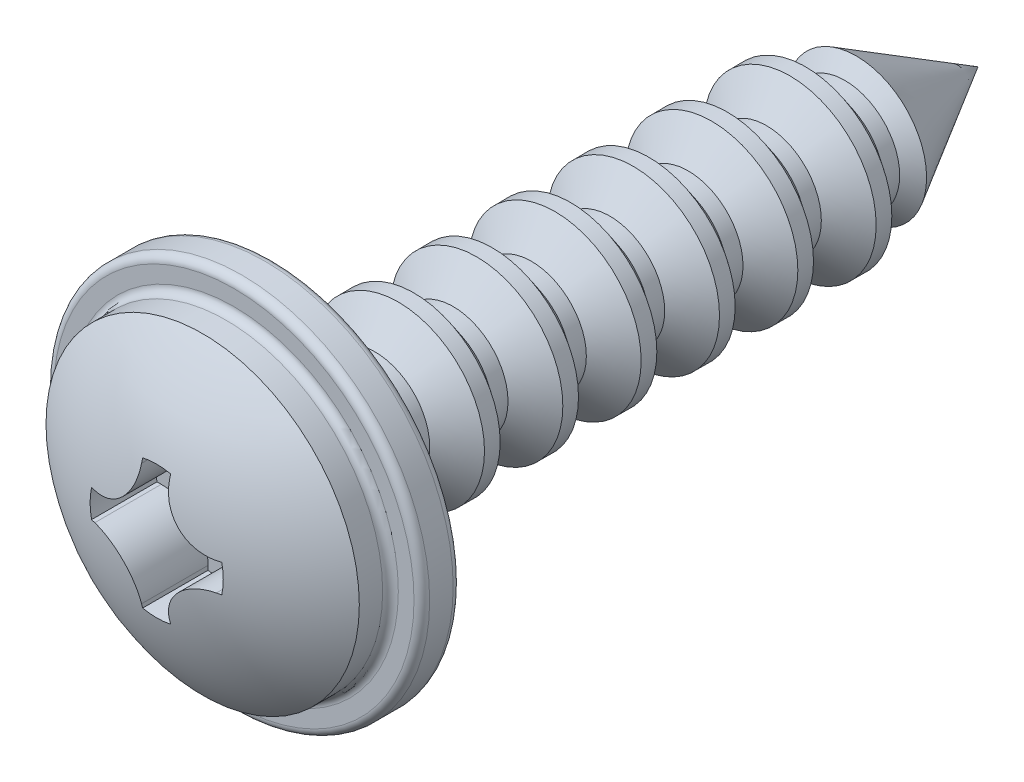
ISO-10303-21;
HEADER;
FILE_DESCRIPTION(('STEP AP214'),'2;1');
FILE_NAME('part.step','',(''),(''),'','','');
FILE_SCHEMA(('AUTOMOTIVE_DESIGN { 1 0 10303 214 1 1 1 1 }'));
ENDSEC;
DATA;
#1=APPLICATION_CONTEXT('core data for automotive mechanical design processes');
#2=APPLICATION_PROTOCOL_DEFINITION('international standard','automotive_design',2000,#1);
#3=PRODUCT_CONTEXT('',#1,'mechanical');
#4=PRODUCT('Part','Part','',(#3));
#5=PRODUCT_RELATED_PRODUCT_CATEGORY('part','',(#4));
#6=PRODUCT_DEFINITION_FORMATION('','',#4);
#7=PRODUCT_DEFINITION_CONTEXT('part definition',#1,'design');
#8=PRODUCT_DEFINITION('design','',#6,#7);
#9=PRODUCT_DEFINITION_SHAPE('','',#8);
#10=(LENGTH_UNIT() NAMED_UNIT(*) SI_UNIT(.MILLI.,.METRE.));
#11=(NAMED_UNIT(*) PLANE_ANGLE_UNIT() SI_UNIT($,.RADIAN.));
#12=(NAMED_UNIT(*) SI_UNIT($,.STERADIAN.) SOLID_ANGLE_UNIT());
#13=UNCERTAINTY_MEASURE_WITH_UNIT(LENGTH_MEASURE(1.E-05),#10,'distance_accuracy_value','');
#14=(GEOMETRIC_REPRESENTATION_CONTEXT(3) GLOBAL_UNCERTAINTY_ASSIGNED_CONTEXT((#13)) GLOBAL_UNIT_ASSIGNED_CONTEXT((#10,
#11,#12)) REPRESENTATION_CONTEXT('',''));
#15=CARTESIAN_POINT('',(0.,0.,0.));
#16=DIRECTION('',(0.,0.,1.));
#17=DIRECTION('',(1.,0.,0.));
#18=AXIS2_PLACEMENT_3D('',#15,#16,#17);
#19=CARTESIAN_POINT('',(0.,0.,1.55267290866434));
#20=DIRECTION('',(0.,0.,1.));
#21=DIRECTION('',(1.,0.,0.));
#22=AXIS2_PLACEMENT_3D('',#19,#20,#21);
#23=CONICAL_SURFACE('',#22,0.896436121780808,0.523598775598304);
#24=CARTESIAN_POINT('',(0.,0.,0.));
#25=VERTEX_POINT('',#24);
#26=VERTEX_LOOP('',#25);
#27=FACE_BOUND('',#26,.T.);
#28=CARTESIAN_POINT('',(0.,0.,1.55267290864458));
#29=DIRECTION('',(0.,0.,-1.));
#30=DIRECTION('',(-1.,0.,0.));
#31=AXIS2_PLACEMENT_3D('',#28,#29,#30);
#32=CIRCLE('',#31,0.896436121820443);
#33=CARTESIAN_POINT('',(-0.896436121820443,0.,1.55267290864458));
#34=VERTEX_POINT('',#33);
#35=EDGE_CURVE('E246',#34,#34,#32,.F.);
#36=ORIENTED_EDGE('',*,*,#35,.F.);
#37=EDGE_LOOP('',(#36));
#38=FACE_BOUND('',#37,.T.);
#39=ADVANCED_FACE('F17',(#27,#38),#23,.T.);
#40=CARTESIAN_POINT('',(0.,0.,1.55267290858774));
#41=DIRECTION('',(0.,0.,-1.));
#42=DIRECTION('',(-1.,0.,0.));
#43=AXIS2_PLACEMENT_3D('',#40,#41,#42);
#44=CONICAL_SURFACE('',#43,0.896436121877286,0.927295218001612);
#45=ORIENTED_EDGE('',*,*,#35,.T.);
#46=EDGE_LOOP('',(#45));
#47=FACE_BOUND('',#46,.T.);
#48=CARTESIAN_POINT('',(0.,0.,1.7));
#49=DIRECTION('',(0.,0.,1.));
#50=DIRECTION('',(1.,0.,0.));
#51=AXIS2_PLACEMENT_3D('',#48,#49,#50);
#52=CIRCLE('',#51,0.7);
#53=CARTESIAN_POINT('',(0.7,0.,1.7));
#54=VERTEX_POINT('',#53);
#55=EDGE_CURVE('E243',#54,#54,#52,.T.);
#56=ORIENTED_EDGE('',*,*,#55,.F.);
#57=EDGE_LOOP('',(#56));
#58=FACE_BOUND('',#57,.T.);
#59=ADVANCED_FACE('F993',(#47,#58),#44,.T.);
#60=CARTESIAN_POINT('',(0.,0.,6.91197860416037));
#61=DIRECTION('',(0.,0.,1.));
#62=DIRECTION('',(1.,0.,0.));
#63=AXIS2_PLACEMENT_3D('',#60,#61,#62);
#64=CYLINDRICAL_SURFACE('',#63,0.7);
#65=CARTESIAN_POINT('',(0.,0.,1.89999999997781));
#66=DIRECTION('',(0.,0.,1.));
#67=DIRECTION('',(1.,0.,0.));
#68=AXIS2_PLACEMENT_3D('',#65,#66,#67);
#69=CIRCLE('',#68,0.699999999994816);
#70=CARTESIAN_POINT('',(0.699999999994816,0.,1.89999999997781));
#71=VERTEX_POINT('',#70);
#72=EDGE_CURVE('E240',#71,#71,#69,.T.);
#73=ORIENTED_EDGE('',*,*,#72,.F.);
#74=EDGE_LOOP('',(#73));
#75=FACE_BOUND('',#74,.T.);
#76=ORIENTED_EDGE('',*,*,#55,.T.);
#77=EDGE_LOOP('',(#76));
#78=FACE_BOUND('',#77,.T.);
#79=ADVANCED_FACE('F983',(#75,#78),#64,.T.);
#80=CARTESIAN_POINT('',(0.,0.,2.20000000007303));
#81=DIRECTION('',(0.,0.,1.));
#82=DIRECTION('',(1.,0.,0.));
#83=AXIS2_PLACEMENT_3D('',#80,#81,#82);
#84=CONICAL_SURFACE('',#83,1.10000000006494,0.927295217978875);
#85=CARTESIAN_POINT('',(0.,0.,2.2));
#86=DIRECTION('',(0.,0.,1.));
#87=DIRECTION('',(1.,0.,0.));
#88=AXIS2_PLACEMENT_3D('',#85,#86,#87);
#89=CIRCLE('',#88,1.1);
#90=CARTESIAN_POINT('',(1.1,0.,2.2));
#91=VERTEX_POINT('',#90);
#92=EDGE_CURVE('E237',#91,#91,#89,.T.);
#93=ORIENTED_EDGE('',*,*,#92,.F.);
#94=EDGE_LOOP('',(#93));
#95=FACE_BOUND('',#94,.T.);
#96=ORIENTED_EDGE('',*,*,#72,.T.);
#97=EDGE_LOOP('',(#96));
#98=FACE_BOUND('',#97,.T.);
#99=ADVANCED_FACE('F973',(#95,#98),#84,.T.);
#100=CARTESIAN_POINT('',(0.,0.,11.71));
#101=DIRECTION('',(0.,0.,1.));
#102=DIRECTION('',(1.,0.,0.));
#103=AXIS2_PLACEMENT_3D('',#100,#101,#102);
#104=CYLINDRICAL_SURFACE('',#103,1.1);
#105=CARTESIAN_POINT('',(0.,0.,2.39999999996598));
#106=DIRECTION('',(0.,0.,-1.));
#107=DIRECTION('',(-1.,0.,0.));
#108=AXIS2_PLACEMENT_3D('',#105,#106,#107);
#109=CIRCLE('',#108,1.10000000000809);
#110=CARTESIAN_POINT('',(-1.10000000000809,0.,2.39999999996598));
#111=VERTEX_POINT('',#110);
#112=EDGE_CURVE('E234',#111,#111,#109,.F.);
#113=ORIENTED_EDGE('',*,*,#112,.F.);
#114=EDGE_LOOP('',(#113));
#115=FACE_BOUND('',#114,.T.);
#116=ORIENTED_EDGE('',*,*,#92,.T.);
#117=EDGE_LOOP('',(#116));
#118=FACE_BOUND('',#117,.T.);
#119=ADVANCED_FACE('F963',(#115,#118),#104,.T.);
#120=CARTESIAN_POINT('',(0.,0.,2.40000000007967));
#121=DIRECTION('',(0.,0.,-1.));
#122=DIRECTION('',(-1.,0.,0.));
#123=AXIS2_PLACEMENT_3D('',#120,#121,#122);
#124=CONICAL_SURFACE('',#123,1.09999999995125,0.927295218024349);
#125=ORIENTED_EDGE('',*,*,#112,.T.);
#126=EDGE_LOOP('',(#125));
#127=FACE_BOUND('',#126,.T.);
#128=CARTESIAN_POINT('',(0.,0.,2.7));
#129=DIRECTION('',(0.,0.,1.));
#130=DIRECTION('',(1.,0.,0.));
#131=AXIS2_PLACEMENT_3D('',#128,#129,#130);
#132=CIRCLE('',#131,0.699999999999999);
#133=CARTESIAN_POINT('',(0.699999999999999,0.,2.7));
#134=VERTEX_POINT('',#133);
#135=EDGE_CURVE('E231',#134,#134,#132,.T.);
#136=ORIENTED_EDGE('',*,*,#135,.F.);
#137=EDGE_LOOP('',(#136));
#138=FACE_BOUND('',#137,.T.);
#139=ADVANCED_FACE('F953',(#127,#138),#124,.T.);
#140=CARTESIAN_POINT('',(0.,0.,6.91197860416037));
#141=DIRECTION('',(0.,0.,1.));
#142=DIRECTION('',(1.,0.,0.));
#143=AXIS2_PLACEMENT_3D('',#140,#141,#142);
#144=CYLINDRICAL_SURFACE('',#143,0.699999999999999);
#145=CARTESIAN_POINT('',(0.,0.,2.900000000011));
#146=DIRECTION('',(0.,0.,1.));
#147=DIRECTION('',(1.,0.,0.));
#148=AXIS2_PLACEMENT_3D('',#145,#146,#147);
#149=CIRCLE('',#148,0.699999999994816);
#150=CARTESIAN_POINT('',(0.699999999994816,0.,2.900000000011));
#151=VERTEX_POINT('',#150);
#152=EDGE_CURVE('E228',#151,#151,#149,.T.);
#153=ORIENTED_EDGE('',*,*,#152,.F.);
#154=EDGE_LOOP('',(#153));
#155=FACE_BOUND('',#154,.T.);
#156=ORIENTED_EDGE('',*,*,#135,.T.);
#157=EDGE_LOOP('',(#156));
#158=FACE_BOUND('',#157,.T.);
#159=ADVANCED_FACE('F943',(#155,#158),#144,.T.);
#160=CARTESIAN_POINT('',(0.,0.,3.19999999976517));
#161=DIRECTION('',(0.,0.,1.));
#162=DIRECTION('',(1.,0.,0.));
#163=AXIS2_PLACEMENT_3D('',#160,#161,#162);
#164=CONICAL_SURFACE('',#163,1.09999999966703,0.927295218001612);
#165=CARTESIAN_POINT('',(0.,0.,3.2));
#166=DIRECTION('',(0.,0.,1.));
#167=DIRECTION('',(1.,0.,0.));
#168=AXIS2_PLACEMENT_3D('',#165,#166,#167);
#169=CIRCLE('',#168,1.1);
#170=CARTESIAN_POINT('',(1.1,0.,3.2));
#171=VERTEX_POINT('',#170);
#172=EDGE_CURVE('E225',#171,#171,#169,.T.);
#173=ORIENTED_EDGE('',*,*,#172,.F.);
#174=EDGE_LOOP('',(#173));
#175=FACE_BOUND('',#174,.T.);
#176=ORIENTED_EDGE('',*,*,#152,.T.);
#177=EDGE_LOOP('',(#176));
#178=FACE_BOUND('',#177,.T.);
#179=ADVANCED_FACE('F933',(#175,#178),#164,.T.);
#180=CARTESIAN_POINT('',(0.,0.,11.71));
#181=DIRECTION('',(0.,0.,1.));
#182=DIRECTION('',(1.,0.,0.));
#183=AXIS2_PLACEMENT_3D('',#180,#181,#182);
#184=CYLINDRICAL_SURFACE('',#183,1.1);
#185=CARTESIAN_POINT('',(0.,0.,3.39999999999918));
#186=DIRECTION('',(0.,0.,-1.));
#187=DIRECTION('',(-1.,0.,0.));
#188=AXIS2_PLACEMENT_3D('',#185,#186,#187);
#189=CIRCLE('',#188,1.10000000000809);
#190=CARTESIAN_POINT('',(-1.10000000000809,0.,3.39999999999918));
#191=VERTEX_POINT('',#190);
#192=EDGE_CURVE('E222',#191,#191,#189,.F.);
#193=ORIENTED_EDGE('',*,*,#192,.F.);
#194=EDGE_LOOP('',(#193));
#195=FACE_BOUND('',#194,.T.);
#196=ORIENTED_EDGE('',*,*,#172,.T.);
#197=EDGE_LOOP('',(#196));
#198=FACE_BOUND('',#197,.T.);
#199=ADVANCED_FACE('F923',(#195,#198),#184,.T.);
#200=CARTESIAN_POINT('',(0.,0.,3.39999999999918));
#201=DIRECTION('',(0.,0.,-1.));
#202=DIRECTION('',(-1.,0.,0.));
#203=AXIS2_PLACEMENT_3D('',#200,#201,#202);
#204=CONICAL_SURFACE('',#203,1.10000000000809,0.927295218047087);
#205=ORIENTED_EDGE('',*,*,#192,.T.);
#206=EDGE_LOOP('',(#205));
#207=FACE_BOUND('',#206,.T.);
#208=CARTESIAN_POINT('',(0.,0.,3.7));
#209=DIRECTION('',(0.,0.,1.));
#210=DIRECTION('',(1.,0.,0.));
#211=AXIS2_PLACEMENT_3D('',#208,#209,#210);
#212=CIRCLE('',#211,0.699999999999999);
#213=CARTESIAN_POINT('',(0.699999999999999,0.,3.7));
#214=VERTEX_POINT('',#213);
#215=EDGE_CURVE('E219',#214,#214,#212,.T.);
#216=ORIENTED_EDGE('',*,*,#215,.F.);
#217=EDGE_LOOP('',(#216));
#218=FACE_BOUND('',#217,.T.);
#219=ADVANCED_FACE('F913',(#207,#218),#204,.T.);
#220=CARTESIAN_POINT('',(0.,0.,6.91197860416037));
#221=DIRECTION('',(0.,0.,1.));
#222=DIRECTION('',(1.,0.,0.));
#223=AXIS2_PLACEMENT_3D('',#220,#221,#222);
#224=CYLINDRICAL_SURFACE('',#223,0.699999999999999);
#225=CARTESIAN_POINT('',(0.,0.,3.9000000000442));
#226=DIRECTION('',(0.,0.,1.));
#227=DIRECTION('',(1.,0.,0.));
#228=AXIS2_PLACEMENT_3D('',#225,#226,#227);
#229=CIRCLE('',#228,0.700000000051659);
#230=CARTESIAN_POINT('',(0.700000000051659,0.,3.9000000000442));
#231=VERTEX_POINT('',#230);
#232=EDGE_CURVE('E216',#231,#231,#229,.T.);
#233=ORIENTED_EDGE('',*,*,#232,.F.);
#234=EDGE_LOOP('',(#233));
#235=FACE_BOUND('',#234,.T.);
#236=ORIENTED_EDGE('',*,*,#215,.T.);
#237=EDGE_LOOP('',(#236));
#238=FACE_BOUND('',#237,.T.);
#239=ADVANCED_FACE('F903',(#235,#238),#224,.T.);
#240=CARTESIAN_POINT('',(0.,0.,4.20000000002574));
#241=DIRECTION('',(0.,0.,1.));
#242=DIRECTION('',(1.,0.,0.));
#243=AXIS2_PLACEMENT_3D('',#240,#241,#242);
#244=CONICAL_SURFACE('',#243,1.10000000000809,0.927295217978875);
#245=CARTESIAN_POINT('',(0.,0.,4.2));
#246=DIRECTION('',(0.,0.,1.));
#247=DIRECTION('',(1.,0.,0.));
#248=AXIS2_PLACEMENT_3D('',#245,#246,#247);
#249=CIRCLE('',#248,1.1);
#250=CARTESIAN_POINT('',(1.1,0.,4.2));
#251=VERTEX_POINT('',#250);
#252=EDGE_CURVE('E213',#251,#251,#249,.T.);
#253=ORIENTED_EDGE('',*,*,#252,.F.);
#254=EDGE_LOOP('',(#253));
#255=FACE_BOUND('',#254,.T.);
#256=ORIENTED_EDGE('',*,*,#232,.T.);
#257=EDGE_LOOP('',(#256));
#258=FACE_BOUND('',#257,.T.);
#259=ADVANCED_FACE('F893',(#255,#258),#244,.T.);
#260=CARTESIAN_POINT('',(0.,0.,11.71));
#261=DIRECTION('',(0.,0.,1.));
#262=DIRECTION('',(1.,0.,0.));
#263=AXIS2_PLACEMENT_3D('',#260,#261,#262);
#264=CYLINDRICAL_SURFACE('',#263,1.1);
#265=CARTESIAN_POINT('',(0.,0.,4.39999999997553));
#266=DIRECTION('',(0.,0.,-1.));
#267=DIRECTION('',(-1.,0.,0.));
#268=AXIS2_PLACEMENT_3D('',#265,#266,#267);
#269=CIRCLE('',#268,1.10000000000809);
#270=CARTESIAN_POINT('',(-1.10000000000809,0.,4.39999999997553));
#271=VERTEX_POINT('',#270);
#272=EDGE_CURVE('E210',#271,#271,#269,.F.);
#273=ORIENTED_EDGE('',*,*,#272,.F.);
#274=EDGE_LOOP('',(#273));
#275=FACE_BOUND('',#274,.T.);
#276=ORIENTED_EDGE('',*,*,#252,.T.);
#277=EDGE_LOOP('',(#276));
#278=FACE_BOUND('',#277,.T.);
#279=ADVANCED_FACE('F883',(#275,#278),#264,.T.);
#280=CARTESIAN_POINT('',(0.,0.,4.40000000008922));
#281=DIRECTION('',(0.,0.,-1.));
#282=DIRECTION('',(-1.,0.,0.));
#283=AXIS2_PLACEMENT_3D('',#280,#281,#282);
#284=CONICAL_SURFACE('',#283,1.09999999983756,0.927295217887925);
#285=ORIENTED_EDGE('',*,*,#272,.T.);
#286=EDGE_LOOP('',(#285));
#287=FACE_BOUND('',#286,.T.);
#288=CARTESIAN_POINT('',(0.,0.,4.7));
#289=DIRECTION('',(0.,0.,1.));
#290=DIRECTION('',(1.,0.,0.));
#291=AXIS2_PLACEMENT_3D('',#288,#289,#290);
#292=CIRCLE('',#291,0.699999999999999);
#293=CARTESIAN_POINT('',(0.699999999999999,0.,4.7));
#294=VERTEX_POINT('',#293);
#295=EDGE_CURVE('E207',#294,#294,#292,.T.);
#296=ORIENTED_EDGE('',*,*,#295,.F.);
#297=EDGE_LOOP('',(#296));
#298=FACE_BOUND('',#297,.T.);
#299=ADVANCED_FACE('F873',(#287,#298),#284,.T.);
#300=CARTESIAN_POINT('',(0.,0.,6.91197860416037));
#301=DIRECTION('',(0.,0.,1.));
#302=DIRECTION('',(1.,0.,0.));
#303=AXIS2_PLACEMENT_3D('',#300,#301,#302);
#304=CYLINDRICAL_SURFACE('',#303,0.699999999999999);
#305=CARTESIAN_POINT('',(0.,0.,4.90000000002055));
#306=DIRECTION('',(0.,0.,1.));
#307=DIRECTION('',(1.,0.,0.));
#308=AXIS2_PLACEMENT_3D('',#305,#306,#307);
#309=CIRCLE('',#308,0.700000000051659);
#310=CARTESIAN_POINT('',(0.700000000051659,0.,4.90000000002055));
#311=VERTEX_POINT('',#310);
#312=EDGE_CURVE('E204',#311,#311,#309,.T.);
#313=ORIENTED_EDGE('',*,*,#312,.F.);
#314=EDGE_LOOP('',(#313));
#315=FACE_BOUND('',#314,.T.);
#316=ORIENTED_EDGE('',*,*,#295,.T.);
#317=EDGE_LOOP('',(#316));
#318=FACE_BOUND('',#317,.T.);
#319=ADVANCED_FACE('F863',(#315,#318),#304,.T.);
#320=CARTESIAN_POINT('',(0.,0.,5.19999999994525));
#321=DIRECTION('',(0.,0.,1.));
#322=DIRECTION('',(1.,0.,0.));
#323=AXIS2_PLACEMENT_3D('',#320,#321,#322);
#324=CONICAL_SURFACE('',#323,1.09999999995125,0.927295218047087);
#325=CARTESIAN_POINT('',(0.,0.,5.2));
#326=DIRECTION('',(0.,0.,1.));
#327=DIRECTION('',(1.,0.,0.));
#328=AXIS2_PLACEMENT_3D('',#325,#326,#327);
#329=CIRCLE('',#328,1.1);
#330=CARTESIAN_POINT('',(1.1,0.,5.2));
#331=VERTEX_POINT('',#330);
#332=EDGE_CURVE('E201',#331,#331,#329,.T.);
#333=ORIENTED_EDGE('',*,*,#332,.F.);
#334=EDGE_LOOP('',(#333));
#335=FACE_BOUND('',#334,.T.);
#336=ORIENTED_EDGE('',*,*,#312,.T.);
#337=EDGE_LOOP('',(#336));
#338=FACE_BOUND('',#337,.T.);
#339=ADVANCED_FACE('F853',(#335,#338),#324,.T.);
#340=CARTESIAN_POINT('',(0.,0.,11.71));
#341=DIRECTION('',(0.,0.,1.));
#342=DIRECTION('',(1.,0.,0.));
#343=AXIS2_PLACEMENT_3D('',#340,#341,#342);
#344=CYLINDRICAL_SURFACE('',#343,1.1);
#345=CARTESIAN_POINT('',(0.,0.,5.39999999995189));
#346=DIRECTION('',(0.,0.,-1.));
#347=DIRECTION('',(-1.,0.,0.));
#348=AXIS2_PLACEMENT_3D('',#345,#346,#347);
#349=CIRCLE('',#348,1.10000000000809);
#350=CARTESIAN_POINT('',(-1.10000000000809,0.,5.39999999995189));
#351=VERTEX_POINT('',#350);
#352=EDGE_CURVE('E198',#351,#351,#349,.F.);
#353=ORIENTED_EDGE('',*,*,#352,.F.);
#354=EDGE_LOOP('',(#353));
#355=FACE_BOUND('',#354,.T.);
#356=ORIENTED_EDGE('',*,*,#332,.T.);
#357=EDGE_LOOP('',(#356));
#358=FACE_BOUND('',#357,.T.);
#359=ADVANCED_FACE('F843',(#355,#358),#344,.T.);
#360=CARTESIAN_POINT('',(0.,0.,5.39999999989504));
#361=DIRECTION('',(0.,0.,-1.));
#362=DIRECTION('',(-1.,0.,0.));
#363=AXIS2_PLACEMENT_3D('',#360,#361,#362);
#364=CONICAL_SURFACE('',#363,1.10000000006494,0.9272952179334);
#365=ORIENTED_EDGE('',*,*,#352,.T.);
#366=EDGE_LOOP('',(#365));
#367=FACE_BOUND('',#366,.T.);
#368=CARTESIAN_POINT('',(0.,0.,5.7));
#369=DIRECTION('',(0.,0.,1.));
#370=DIRECTION('',(1.,0.,0.));
#371=AXIS2_PLACEMENT_3D('',#368,#369,#370);
#372=CIRCLE('',#371,0.699999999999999);
#373=CARTESIAN_POINT('',(0.699999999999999,0.,5.7));
#374=VERTEX_POINT('',#373);
#375=EDGE_CURVE('E195',#374,#374,#372,.T.);
#376=ORIENTED_EDGE('',*,*,#375,.F.);
#377=EDGE_LOOP('',(#376));
#378=FACE_BOUND('',#377,.T.);
#379=ADVANCED_FACE('F833',(#367,#378),#364,.T.);
#380=CARTESIAN_POINT('',(0.,0.,6.91197860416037));
#381=DIRECTION('',(0.,0.,1.));
#382=DIRECTION('',(1.,0.,0.));
#383=AXIS2_PLACEMENT_3D('',#380,#381,#382);
#384=CYLINDRICAL_SURFACE('',#383,0.699999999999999);
#385=CARTESIAN_POINT('',(0.,0.,5.89999999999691));
#386=DIRECTION('',(0.,0.,1.));
#387=DIRECTION('',(1.,0.,0.));
#388=AXIS2_PLACEMENT_3D('',#385,#386,#387);
#389=CIRCLE('',#388,0.699999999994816);
#390=CARTESIAN_POINT('',(0.699999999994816,0.,5.89999999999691));
#391=VERTEX_POINT('',#390);
#392=EDGE_CURVE('E192',#391,#391,#389,.T.);
#393=ORIENTED_EDGE('',*,*,#392,.F.);
#394=EDGE_LOOP('',(#393));
#395=FACE_BOUND('',#394,.T.);
#396=ORIENTED_EDGE('',*,*,#375,.T.);
#397=EDGE_LOOP('',(#396));
#398=FACE_BOUND('',#397,.T.);
#399=ADVANCED_FACE('F823',(#395,#398),#384,.T.);
#400=CARTESIAN_POINT('',(0.,0.,6.19999999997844));
#401=DIRECTION('',(0.,0.,1.));
#402=DIRECTION('',(1.,0.,0.));
#403=AXIS2_PLACEMENT_3D('',#400,#401,#402);
#404=CONICAL_SURFACE('',#403,1.10000000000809,0.927295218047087);
#405=CARTESIAN_POINT('',(0.,0.,6.2));
#406=DIRECTION('',(0.,0.,1.));
#407=DIRECTION('',(1.,0.,0.));
#408=AXIS2_PLACEMENT_3D('',#405,#406,#407);
#409=CIRCLE('',#408,1.1);
#410=CARTESIAN_POINT('',(1.1,0.,6.2));
#411=VERTEX_POINT('',#410);
#412=EDGE_CURVE('E189',#411,#411,#409,.T.);
#413=ORIENTED_EDGE('',*,*,#412,.F.);
#414=EDGE_LOOP('',(#413));
#415=FACE_BOUND('',#414,.T.);
#416=ORIENTED_EDGE('',*,*,#392,.T.);
#417=EDGE_LOOP('',(#416));
#418=FACE_BOUND('',#417,.T.);
#419=ADVANCED_FACE('F813',(#415,#418),#404,.T.);
#420=CARTESIAN_POINT('',(0.,0.,11.71));
#421=DIRECTION('',(0.,0.,1.));
#422=DIRECTION('',(1.,0.,0.));
#423=AXIS2_PLACEMENT_3D('',#420,#421,#422);
#424=CYLINDRICAL_SURFACE('',#423,1.1);
#425=CARTESIAN_POINT('',(0.,0.,6.40000000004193));
#426=DIRECTION('',(0.,0.,-1.));
#427=DIRECTION('',(-1.,0.,0.));
#428=AXIS2_PLACEMENT_3D('',#425,#426,#427);
#429=CIRCLE('',#428,1.10000000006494);
#430=CARTESIAN_POINT('',(-1.10000000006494,0.,6.40000000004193));
#431=VERTEX_POINT('',#430);
#432=EDGE_CURVE('E186',#431,#431,#429,.F.);
#433=ORIENTED_EDGE('',*,*,#432,.F.);
#434=EDGE_LOOP('',(#433));
#435=FACE_BOUND('',#434,.T.);
#436=ORIENTED_EDGE('',*,*,#412,.T.);
#437=EDGE_LOOP('',(#436));
#438=FACE_BOUND('',#437,.T.);
#439=ADVANCED_FACE('F804',(#435,#438),#424,.T.);
#440=CARTESIAN_POINT('',(0.,0.,9.65));
#441=DIRECTION('',(0.,0.,-1.));
#442=DIRECTION('',(-1.,0.,0.));
#443=AXIS2_PLACEMENT_3D('',#440,#441,#442);
#444=PLANE('',#443);
#445=DIRECTION('',(0.,-1.,0.));
#446=VECTOR('',#445,1.);
#447=CARTESIAN_POINT('',(-0.178947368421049,0.830949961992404,9.65));
#448=LINE('',#447,#446);
#449=CARTESIAN_POINT('',(-0.178947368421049,0.830949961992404,9.65));
#450=VERTEX_POINT('',#449);
#451=CARTESIAN_POINT('',(-0.178947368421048,0.776447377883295,9.65));
#452=VERTEX_POINT('',#451);
#453=EDGE_CURVE('E332',#450,#452,#448,.T.);
#454=ORIENTED_EDGE('',*,*,#453,.T.);
#455=CARTESIAN_POINT('',(-0.776447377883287,0.776447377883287,9.65));
#456=DIRECTION('',(0.,0.,1.));
#457=DIRECTION('',(1.,0.,0.));
#458=AXIS2_PLACEMENT_3D('',#455,#456,#457);
#459=CIRCLE('',#458,0.597500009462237);
#460=CARTESIAN_POINT('',(-0.776447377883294,0.178947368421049,9.65));
#461=VERTEX_POINT('',#460);
#462=EDGE_CURVE('E336',#461,#452,#459,.T.);
#463=ORIENTED_EDGE('',*,*,#462,.F.);
#464=DIRECTION('',(1.,0.,0.));
#465=VECTOR('',#464,1.);
#466=CARTESIAN_POINT('',(-0.830949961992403,0.17894736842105,9.65));
#467=LINE('',#466,#465);
#468=CARTESIAN_POINT('',(-0.830949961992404,0.17894736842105,9.65));
#469=VERTEX_POINT('',#468);
#470=EDGE_CURVE('E184',#469,#461,#467,.T.);
#471=ORIENTED_EDGE('',*,*,#470,.F.);
#472=CARTESIAN_POINT('',(0.,0.,9.65));
#473=DIRECTION('',(0.,0.,1.));
#474=DIRECTION('',(1.,0.,0.));
#475=AXIS2_PLACEMENT_3D('',#472,#473,#474);
#476=CIRCLE('',#475,0.849999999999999);
#477=CARTESIAN_POINT('',(-0.830949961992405,-0.178947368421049,9.65));
#478=VERTEX_POINT('',#477);
#479=EDGE_CURVE('E175',#469,#478,#476,.T.);
#480=ORIENTED_EDGE('',*,*,#479,.T.);
#481=DIRECTION('',(1.,0.,0.));
#482=VECTOR('',#481,1.);
#483=CARTESIAN_POINT('',(-0.830949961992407,-0.178947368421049,9.65));
#484=LINE('',#483,#482);
#485=CARTESIAN_POINT('',(-0.776447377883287,-0.178947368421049,9.65));
#486=VERTEX_POINT('',#485);
#487=EDGE_CURVE('E168',#478,#486,#484,.T.);
#488=ORIENTED_EDGE('',*,*,#487,.T.);
#489=CARTESIAN_POINT('',(-0.776447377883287,-0.776447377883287,9.65));
#490=DIRECTION('',(0.,0.,1.));
#491=DIRECTION('',(1.,0.,0.));
#492=AXIS2_PLACEMENT_3D('',#489,#490,#491);
#493=CIRCLE('',#492,0.597500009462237);
#494=CARTESIAN_POINT('',(-0.17894736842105,-0.776447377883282,9.65));
#495=VERTEX_POINT('',#494);
#496=EDGE_CURVE('E159',#495,#486,#493,.T.);
#497=ORIENTED_EDGE('',*,*,#496,.F.);
#498=DIRECTION('',(0.,1.,0.));
#499=VECTOR('',#498,1.);
#500=CARTESIAN_POINT('',(-0.178947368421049,-0.830949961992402,9.65));
#501=LINE('',#500,#499);
#502=CARTESIAN_POINT('',(-0.178947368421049,-0.830949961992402,9.65));
#503=VERTEX_POINT('',#502);
#504=EDGE_CURVE('E153',#503,#495,#501,.T.);
#505=ORIENTED_EDGE('',*,*,#504,.F.);
#506=CARTESIAN_POINT('',(0.,0.,9.65));
#507=DIRECTION('',(0.,0.,1.));
#508=DIRECTION('',(1.,0.,0.));
#509=AXIS2_PLACEMENT_3D('',#506,#507,#508);
#510=CIRCLE('',#509,0.849999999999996);
#511=CARTESIAN_POINT('',(0.178947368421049,-0.830949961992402,9.65));
#512=VERTEX_POINT('',#511);
#513=EDGE_CURVE('E295',#503,#512,#510,.T.);
#514=ORIENTED_EDGE('',*,*,#513,.T.);
#515=DIRECTION('',(0.,1.,0.));
#516=VECTOR('',#515,1.);
#517=CARTESIAN_POINT('',(0.178947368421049,-0.830949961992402,9.65));
#518=LINE('',#517,#516);
#519=CARTESIAN_POINT('',(0.17894736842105,-0.776447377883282,9.65));
#520=VERTEX_POINT('',#519);
#521=EDGE_CURVE('E300',#512,#520,#518,.T.);
#522=ORIENTED_EDGE('',*,*,#521,.T.);
#523=CARTESIAN_POINT('',(0.776447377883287,-0.776447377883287,9.65));
#524=DIRECTION('',(0.,0.,1.));
#525=DIRECTION('',(1.,0.,0.));
#526=AXIS2_PLACEMENT_3D('',#523,#524,#525);
#527=CIRCLE('',#526,0.597500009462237);
#528=CARTESIAN_POINT('',(0.776447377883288,-0.178947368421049,9.65));
#529=VERTEX_POINT('',#528);
#530=EDGE_CURVE('E304',#529,#520,#527,.T.);
#531=ORIENTED_EDGE('',*,*,#530,.F.);
#532=DIRECTION('',(-1.,0.,0.));
#533=VECTOR('',#532,1.);
#534=CARTESIAN_POINT('',(0.830949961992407,-0.17894736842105,9.65));
#535=LINE('',#534,#533);
#536=CARTESIAN_POINT('',(0.830949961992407,-0.17894736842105,9.65));
#537=VERTEX_POINT('',#536);
#538=EDGE_CURVE('E305',#537,#529,#535,.T.);
#539=ORIENTED_EDGE('',*,*,#538,.F.);
#540=CARTESIAN_POINT('',(0.,0.,9.65));
#541=DIRECTION('',(0.,0.,1.));
#542=DIRECTION('',(1.,0.,0.));
#543=AXIS2_PLACEMENT_3D('',#540,#541,#542);
#544=CIRCLE('',#543,0.850000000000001);
#545=CARTESIAN_POINT('',(0.830949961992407,0.17894736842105,9.65));
#546=VERTEX_POINT('',#545);
#547=EDGE_CURVE('E309',#537,#546,#544,.T.);
#548=ORIENTED_EDGE('',*,*,#547,.T.);
#549=DIRECTION('',(-1.,0.,0.));
#550=VECTOR('',#549,1.);
#551=CARTESIAN_POINT('',(0.830949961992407,0.17894736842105,9.65));
#552=LINE('',#551,#550);
#553=CARTESIAN_POINT('',(0.776447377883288,0.178947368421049,9.65));
#554=VERTEX_POINT('',#553);
#555=EDGE_CURVE('E316',#546,#554,#552,.T.);
#556=ORIENTED_EDGE('',*,*,#555,.T.);
#557=CARTESIAN_POINT('',(0.776447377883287,0.776447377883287,9.65));
#558=DIRECTION('',(0.,0.,1.));
#559=DIRECTION('',(1.,0.,0.));
#560=AXIS2_PLACEMENT_3D('',#557,#558,#559);
#561=CIRCLE('',#560,0.597500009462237);
#562=CARTESIAN_POINT('',(0.178947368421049,0.776447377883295,9.65));
#563=VERTEX_POINT('',#562);
#564=EDGE_CURVE('E320',#563,#554,#561,.T.);
#565=ORIENTED_EDGE('',*,*,#564,.F.);
#566=DIRECTION('',(0.,-1.,0.));
#567=VECTOR('',#566,1.);
#568=CARTESIAN_POINT('',(0.178947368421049,0.830949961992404,9.65));
#569=LINE('',#568,#567);
#570=CARTESIAN_POINT('',(0.178947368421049,0.830949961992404,9.65));
#571=VERTEX_POINT('',#570);
#572=EDGE_CURVE('E321',#571,#563,#569,.T.);
#573=ORIENTED_EDGE('',*,*,#572,.F.);
#574=CARTESIAN_POINT('',(0.,0.,9.65));
#575=DIRECTION('',(0.,0.,1.));
#576=DIRECTION('',(1.,0.,0.));
#577=AXIS2_PLACEMENT_3D('',#574,#575,#576);
#578=CIRCLE('',#577,0.849999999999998);
#579=EDGE_CURVE('E328',#571,#450,#578,.T.);
#580=ORIENTED_EDGE('',*,*,#579,.T.);
#581=EDGE_LOOP('',(#454,#463,#471,#480,#488,#497,#505,#514,#522,#531,#539,#548,#556,#565,#573,#580));
#582=FACE_BOUND('',#581,.T.);
#583=ADVANCED_FACE('F179',(#582),#444,.F.);
#584=CARTESIAN_POINT('',(0.,0.,6.40000000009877));
#585=DIRECTION('',(0.,0.,-1.));
#586=DIRECTION('',(0.,1.,0.));
#587=AXIS2_PLACEMENT_3D('',#584,#585,#586);
#588=CONICAL_SURFACE('',#587,1.09999999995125,0.927295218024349);
#589=ORIENTED_EDGE('',*,*,#432,.T.);
#590=EDGE_LOOP('',(#589));
#591=FACE_BOUND('',#590,.T.);
#592=CARTESIAN_POINT('',(0.,0.,6.7));
#593=DIRECTION('',(0.,0.,1.));
#594=DIRECTION('',(1.,0.,0.));
#595=AXIS2_PLACEMENT_3D('',#592,#593,#594);
#596=CIRCLE('',#595,0.699999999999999);
#597=CARTESIAN_POINT('',(0.699999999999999,0.,6.7));
#598=VERTEX_POINT('',#597);
#599=EDGE_CURVE('E294',#598,#598,#596,.T.);
#600=ORIENTED_EDGE('',*,*,#599,.F.);
#601=EDGE_LOOP('',(#600));
#602=FACE_BOUND('',#601,.T.);
#603=ADVANCED_FACE('F786',(#591,#602),#588,.T.);
#604=CARTESIAN_POINT('',(-0.178947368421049,-0.830949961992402,9.65));
#605=DIRECTION('',(1.,0.,0.));
#606=DIRECTION('',(0.,1.,0.));
#607=AXIS2_PLACEMENT_3D('',#604,#605,#606);
#608=PLANE('',#607);
#609=ORIENTED_EDGE('',*,*,#504,.T.);
#610=DIRECTION('',(0.,0.,1.));
#611=VECTOR('',#610,1.);
#612=CARTESIAN_POINT('',(-0.178947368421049,-0.776447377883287,9.65));
#613=LINE('',#612,#611);
#614=CARTESIAN_POINT('',(-0.17894736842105,-0.776447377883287,10.4992107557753));
#615=VERTEX_POINT('',#614);
#616=EDGE_CURVE('E165',#615,#495,#613,.F.);
#617=ORIENTED_EDGE('',*,*,#616,.F.);
#618=CARTESIAN_POINT('',(-0.17894736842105,-0.830949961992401,10.4850445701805));
#619=CARTESIAN_POINT('',(-0.17894736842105,-0.821887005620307,10.4874856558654));
#620=CARTESIAN_POINT('',(-0.17894736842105,-0.812813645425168,10.4898867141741));
#621=CARTESIAN_POINT('',(-0.17894736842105,-0.794646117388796,10.4946087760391));
#622=CARTESIAN_POINT('',(-0.17894736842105,-0.785551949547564,10.4969297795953));
#623=CARTESIAN_POINT('',(-0.17894736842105,-0.776447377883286,10.4992107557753));
#624=B_SPLINE_CURVE_WITH_KNOTS('',3,(#618,#619,#620,#621,#622,#623),.UNSPECIFIED.,.F.,.F.,(4,2,
4),(0.,0.0281570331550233,0.0563140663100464),.UNSPECIFIED.);
#625=CARTESIAN_POINT('',(-0.178947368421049,-0.830949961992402,10.4850445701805));
#626=VERTEX_POINT('',#625);
#627=EDGE_CURVE('E346',#626,#615,#624,.T.);
#628=ORIENTED_EDGE('',*,*,#627,.F.);
#629=DIRECTION('',(0.,0.,1.));
#630=VECTOR('',#629,1.);
#631=CARTESIAN_POINT('',(-0.17894736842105,-0.830949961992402,9.65));
#632=LINE('',#631,#630);
#633=EDGE_CURVE('E299',#626,#503,#632,.F.);
#634=ORIENTED_EDGE('',*,*,#633,.T.);
#635=EDGE_LOOP('',(#609,#617,#628,#634));
#636=FACE_BOUND('',#635,.T.);
#637=ADVANCED_FACE('F777',(#636),#608,.T.);
#638=CARTESIAN_POINT('',(-0.776447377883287,-0.776447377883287,9.65));
#639=DIRECTION('',(0.,0.,1.));
#640=DIRECTION('',(1.,0.,0.));
#641=AXIS2_PLACEMENT_3D('',#638,#639,#640);
#642=CYLINDRICAL_SURFACE('',#641,0.597500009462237);
#643=DIRECTION('',(0.,0.,1.));
#644=VECTOR('',#643,1.);
#645=CARTESIAN_POINT('',(-0.776447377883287,-0.178947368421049,9.65));
#646=LINE('',#645,#644);
#647=CARTESIAN_POINT('',(-0.776447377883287,-0.17894736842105,10.4992107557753));
#648=VERTEX_POINT('',#647);
#649=EDGE_CURVE('E163',#486,#648,#646,.T.);
#650=ORIENTED_EDGE('',*,*,#649,.T.);
#651=CARTESIAN_POINT('',(-0.178947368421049,-0.776447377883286,10.4992107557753));
#652=CARTESIAN_POINT('',(-0.178916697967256,-0.744256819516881,10.5072828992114));
#653=CARTESIAN_POINT('',(-0.181548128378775,-0.711883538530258,10.5147027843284));
#654=CARTESIAN_POINT('',(-0.192091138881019,-0.647668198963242,10.5280540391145));
#655=CARTESIAN_POINT('',(-0.200007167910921,-0.615826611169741,10.5339841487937));
#656=CARTESIAN_POINT('',(-0.221093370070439,-0.553575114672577,10.5441663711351));
#657=CARTESIAN_POINT('',(-0.234272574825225,-0.523167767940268,10.5484155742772));
#658=CARTESIAN_POINT('',(-0.265575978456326,-0.464821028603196,10.5550778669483));
#659=CARTESIAN_POINT('',(-0.283696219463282,-0.436879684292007,10.5574924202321));
#660=CARTESIAN_POINT('',(-0.323771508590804,-0.3851294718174,10.5603620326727));
#661=CARTESIAN_POINT('',(-0.345594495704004,-0.361221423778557,10.560873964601));
#662=CARTESIAN_POINT('',(-0.392795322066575,-0.317255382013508,10.5600792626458));
#663=CARTESIAN_POINT('',(-0.418172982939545,-0.297197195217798,10.5587727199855));
#664=CARTESIAN_POINT('',(-0.471311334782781,-0.261760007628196,10.5544186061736));
#665=CARTESIAN_POINT('',(-0.499030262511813,-0.246314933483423,10.5513976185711));
#666=CARTESIAN_POINT('',(-0.556379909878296,-0.220055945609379,10.5437280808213));
#667=CARTESIAN_POINT('',(-0.586011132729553,-0.209243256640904,10.5390791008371));
#668=CARTESIAN_POINT('',(-0.642447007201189,-0.193528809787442,10.5289893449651));
#669=CARTESIAN_POINT('',(-0.669124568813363,-0.188045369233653,10.5237275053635));
#670=CARTESIAN_POINT('',(-0.722723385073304,-0.18075101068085,10.5121965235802));
#671=CARTESIAN_POINT('',(-0.749644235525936,-0.178934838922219,10.5059288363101));
#672=CARTESIAN_POINT('',(-0.776447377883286,-0.178947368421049,10.4992107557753));
#673=B_SPLINE_CURVE_WITH_KNOTS('',3,(#651,#652,#653,#654,#655,#656,#657,#658,#659,#660,#661,
#662,#663,#664,#665,#666,#667,#668,#669,#670,#671,#672),.UNSPECIFIED.,.F.,.F.,(4,2,2,2,2,2,2,2,
2,2,4),(0.,0.0994785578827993,0.199040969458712,0.298774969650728,0.39842931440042,
0.495079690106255,0.59172521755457,0.686911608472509,0.7821231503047,0.865079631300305,
0.947917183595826),.UNSPECIFIED.);
#674=EDGE_CURVE('E1067',#615,#648,#673,.T.);
#675=ORIENTED_EDGE('',*,*,#674,.F.);
#676=ORIENTED_EDGE('',*,*,#616,.T.);
#677=ORIENTED_EDGE('',*,*,#496,.T.);
#678=EDGE_LOOP('',(#650,#675,#676,#677));
#679=FACE_BOUND('',#678,.T.);
#680=ADVANCED_FACE('F161',(#679),#642,.T.);
#681=CARTESIAN_POINT('',(-0.830949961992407,-0.178947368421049,9.65));
#682=DIRECTION('',(0.,-1.,0.));
#683=DIRECTION('',(1.,0.,0.));
#684=AXIS2_PLACEMENT_3D('',#681,#682,#683);
#685=PLANE('',#684);
#686=ORIENTED_EDGE('',*,*,#487,.F.);
#687=DIRECTION('',(0.,0.,1.));
#688=VECTOR('',#687,1.);
#689=CARTESIAN_POINT('',(-0.830949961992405,-0.178947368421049,9.65));
#690=LINE('',#689,#688);
#691=CARTESIAN_POINT('',(-0.830949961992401,-0.17894736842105,10.4850445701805));
#692=VERTEX_POINT('',#691);
#693=EDGE_CURVE('E340',#478,#692,#690,.T.);
#694=ORIENTED_EDGE('',*,*,#693,.T.);
#695=CARTESIAN_POINT('',(0.,-0.17894736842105,7.4));
#696=DIRECTION('',(0.,1.,0.));
#697=DIRECTION('',(0.,0.,1.));
#698=AXIS2_PLACEMENT_3D('',#695,#696,#697);
#699=CIRCLE('',#698,3.19499261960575);
#700=EDGE_CURVE('E174',#648,#692,#699,.F.);
#701=ORIENTED_EDGE('',*,*,#700,.F.);
#702=ORIENTED_EDGE('',*,*,#649,.F.);
#703=EDGE_LOOP('',(#686,#694,#701,#702));
#704=FACE_BOUND('',#703,.T.);
#705=ADVANCED_FACE('F171',(#704),#685,.F.);
#706=CARTESIAN_POINT('',(0.,0.,9.65));
#707=DIRECTION('',(0.,0.,1.));
#708=DIRECTION('',(1.,0.,0.));
#709=AXIS2_PLACEMENT_3D('',#706,#707,#708);
#710=CYLINDRICAL_SURFACE('',#709,0.849999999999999);
#711=ORIENTED_EDGE('',*,*,#693,.F.);
#712=ORIENTED_EDGE('',*,*,#479,.F.);
#713=DIRECTION('',(0.,0.,1.));
#714=VECTOR('',#713,1.);
#715=CARTESIAN_POINT('',(-0.830949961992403,0.17894736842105,9.65));
#716=LINE('',#715,#714);
#717=CARTESIAN_POINT('',(-0.830949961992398,0.17894736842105,10.4850445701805));
#718=VERTEX_POINT('',#717);
#719=EDGE_CURVE('E337',#718,#469,#716,.F.);
#720=ORIENTED_EDGE('',*,*,#719,.F.);
#721=CARTESIAN_POINT('',(0.,0.,10.4850445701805));
#722=DIRECTION('',(0.,0.,1.));
#723=DIRECTION('',(1.,0.,0.));
#724=AXIS2_PLACEMENT_3D('',#721,#722,#723);
#725=CIRCLE('',#724,0.849999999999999);
#726=EDGE_CURVE('E1125',#692,#718,#725,.F.);
#727=ORIENTED_EDGE('',*,*,#726,.F.);
#728=EDGE_LOOP('',(#711,#712,#720,#727));
#729=FACE_BOUND('',#728,.T.);
#730=ADVANCED_FACE('F750',(#729),#710,.F.);
#731=CARTESIAN_POINT('',(-0.830949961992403,0.17894736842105,9.65));
#732=DIRECTION('',(0.,-1.,0.));
#733=DIRECTION('',(1.,0.,0.));
#734=AXIS2_PLACEMENT_3D('',#731,#732,#733);
#735=PLANE('',#734);
#736=ORIENTED_EDGE('',*,*,#470,.T.);
#737=DIRECTION('',(0.,0.,1.));
#738=VECTOR('',#737,1.);
#739=CARTESIAN_POINT('',(-0.776447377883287,0.178947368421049,9.65));
#740=LINE('',#739,#738);
#741=CARTESIAN_POINT('',(-0.776447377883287,0.17894736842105,10.4992107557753));
#742=VERTEX_POINT('',#741);
#743=EDGE_CURVE('E333',#742,#461,#740,.F.);
#744=ORIENTED_EDGE('',*,*,#743,.F.);
#745=CARTESIAN_POINT('',(0.,0.17894736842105,7.4));
#746=DIRECTION('',(0.,1.,0.));
#747=DIRECTION('',(0.,0.,1.));
#748=AXIS2_PLACEMENT_3D('',#745,#746,#747);
#749=CIRCLE('',#748,3.19499261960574);
#750=EDGE_CURVE('E1123',#718,#742,#749,.T.);
#751=ORIENTED_EDGE('',*,*,#750,.F.);
#752=ORIENTED_EDGE('',*,*,#719,.T.);
#753=EDGE_LOOP('',(#736,#744,#751,#752));
#754=FACE_BOUND('',#753,.T.);
#755=ADVANCED_FACE('F741',(#754),#735,.T.);
#756=CARTESIAN_POINT('',(-0.776447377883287,0.776447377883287,9.65));
#757=DIRECTION('',(0.,0.,1.));
#758=DIRECTION('',(1.,0.,0.));
#759=AXIS2_PLACEMENT_3D('',#756,#757,#758);
#760=CYLINDRICAL_SURFACE('',#759,0.597500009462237);
#761=ORIENTED_EDGE('',*,*,#462,.T.);
#762=DIRECTION('',(0.,0.,1.));
#763=VECTOR('',#762,1.);
#764=CARTESIAN_POINT('',(-0.178947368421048,0.776447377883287,9.65));
#765=LINE('',#764,#763);
#766=CARTESIAN_POINT('',(-0.178947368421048,0.776447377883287,10.4992107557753));
#767=VERTEX_POINT('',#766);
#768=EDGE_CURVE('E329',#452,#767,#765,.T.);
#769=ORIENTED_EDGE('',*,*,#768,.T.);
#770=CARTESIAN_POINT('',(-0.776447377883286,0.17894736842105,10.4992107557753));
#771=CARTESIAN_POINT('',(-0.744256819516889,0.178916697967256,10.5072828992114));
#772=CARTESIAN_POINT('',(-0.711883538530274,0.181548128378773,10.5147027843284));
#773=CARTESIAN_POINT('',(-0.647668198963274,0.192091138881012,10.5280540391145));
#774=CARTESIAN_POINT('',(-0.615826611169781,0.20000716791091,10.5339841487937));
#775=CARTESIAN_POINT('',(-0.553575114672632,0.221093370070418,10.5441663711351));
#776=CARTESIAN_POINT('',(-0.523167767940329,0.234272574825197,10.5484155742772));
#777=CARTESIAN_POINT('',(-0.464821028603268,0.265575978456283,10.5550778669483));
#778=CARTESIAN_POINT('',(-0.436879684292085,0.28369621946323,10.5574924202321));
#779=CARTESIAN_POINT('',(-0.385129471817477,0.323771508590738,10.5603620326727));
#780=CARTESIAN_POINT('',(-0.361221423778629,0.345594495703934,10.560873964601));
#781=CARTESIAN_POINT('',(-0.317255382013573,0.392795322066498,10.5600792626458));
#782=CARTESIAN_POINT('',(-0.297197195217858,0.418172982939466,10.5587727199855));
#783=CARTESIAN_POINT('',(-0.261760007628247,0.471311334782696,10.5544186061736));
#784=CARTESIAN_POINT('',(-0.246314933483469,0.499030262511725,10.5513976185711));
#785=CARTESIAN_POINT('',(-0.220055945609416,0.556379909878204,10.5437280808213));
#786=CARTESIAN_POINT('',(-0.209243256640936,0.586011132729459,10.5390791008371));
#787=CARTESIAN_POINT('',(-0.19352880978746,0.64244700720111,10.5289893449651));
#788=CARTESIAN_POINT('',(-0.188045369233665,0.6691245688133,10.5237275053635));
#789=CARTESIAN_POINT('',(-0.180751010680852,0.722723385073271,10.5121965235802));
#790=CARTESIAN_POINT('',(-0.178934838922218,0.74964423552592,10.5059288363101));
#791=CARTESIAN_POINT('',(-0.178947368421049,0.776447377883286,10.4992107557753));
#792=B_SPLINE_CURVE_WITH_KNOTS('',3,(#770,#771,#772,#773,#774,#775,#776,#777,#778,#779,#780,
#781,#782,#783,#784,#785,#786,#787,#788,#789,#790,#791),.UNSPECIFIED.,.F.,.F.,(4,2,2,2,2,2,2,2,
2,2,4),(0.,0.0994785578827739,0.199040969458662,0.298774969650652,0.398429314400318,
0.495079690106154,0.591725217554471,0.68691160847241,0.7821231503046,0.865079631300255,
0.947917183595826),.UNSPECIFIED.);
#793=EDGE_CURVE('E1118',#742,#767,#792,.T.);
#794=ORIENTED_EDGE('',*,*,#793,.F.);
#795=ORIENTED_EDGE('',*,*,#743,.T.);
#796=EDGE_LOOP('',(#761,#769,#794,#795));
#797=FACE_BOUND('',#796,.T.);
#798=ADVANCED_FACE('F731',(#797),#760,.T.);
#799=CARTESIAN_POINT('',(-0.178947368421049,0.830949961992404,9.65));
#800=DIRECTION('',(-1.,0.,0.));
#801=DIRECTION('',(0.,-1.,0.));
#802=AXIS2_PLACEMENT_3D('',#799,#800,#801);
#803=PLANE('',#802);
#804=ORIENTED_EDGE('',*,*,#453,.F.);
#805=DIRECTION('',(0.,0.,1.));
#806=VECTOR('',#805,1.);
#807=CARTESIAN_POINT('',(-0.178947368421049,0.830949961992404,9.65));
#808=LINE('',#807,#806);
#809=CARTESIAN_POINT('',(-0.17894736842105,0.830949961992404,10.4850445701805));
#810=VERTEX_POINT('',#809);
#811=EDGE_CURVE('E325',#450,#810,#808,.T.);
#812=ORIENTED_EDGE('',*,*,#811,.T.);
#813=CARTESIAN_POINT('',(-0.178947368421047,0.776447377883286,10.4992107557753));
#814=CARTESIAN_POINT('',(-0.178947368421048,0.785551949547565,10.4969297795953));
#815=CARTESIAN_POINT('',(-0.178947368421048,0.794646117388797,10.4946087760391));
#816=CARTESIAN_POINT('',(-0.178947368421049,0.81281364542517,10.4898867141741));
#817=CARTESIAN_POINT('',(-0.17894736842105,0.82188700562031,10.4874856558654));
#818=CARTESIAN_POINT('',(-0.17894736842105,0.830949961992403,10.4850445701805));
#819=B_SPLINE_CURVE_WITH_KNOTS('',3,(#813,#814,#815,#816,#817,#818),.UNSPECIFIED.,.F.,.F.,(4,2,
4),(0.,0.0281570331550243,0.0563140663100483),.UNSPECIFIED.);
#820=EDGE_CURVE('E1111',#767,#810,#819,.T.);
#821=ORIENTED_EDGE('',*,*,#820,.F.);
#822=ORIENTED_EDGE('',*,*,#768,.F.);
#823=EDGE_LOOP('',(#804,#812,#821,#822));
#824=FACE_BOUND('',#823,.T.);
#825=ADVANCED_FACE('F721',(#824),#803,.F.);
#826=CARTESIAN_POINT('',(0.,0.,9.65));
#827=DIRECTION('',(0.,0.,1.));
#828=DIRECTION('',(1.,0.,0.));
#829=AXIS2_PLACEMENT_3D('',#826,#827,#828);
#830=CYLINDRICAL_SURFACE('',#829,0.849999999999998);
#831=CARTESIAN_POINT('',(0.,0.,10.4850445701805));
#832=DIRECTION('',(0.,0.,1.));
#833=DIRECTION('',(1.,0.,0.));
#834=AXIS2_PLACEMENT_3D('',#831,#832,#833);
#835=CIRCLE('',#834,0.849999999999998);
#836=CARTESIAN_POINT('',(0.178947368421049,0.830949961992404,10.4850445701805));
#837=VERTEX_POINT('',#836);
#838=EDGE_CURVE('E1117',#810,#837,#835,.F.);
#839=ORIENTED_EDGE('',*,*,#838,.F.);
#840=ORIENTED_EDGE('',*,*,#811,.F.);
#841=ORIENTED_EDGE('',*,*,#579,.F.);
#842=DIRECTION('',(0.,0.,1.));
#843=VECTOR('',#842,1.);
#844=CARTESIAN_POINT('',(0.178947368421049,0.830949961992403,9.65));
#845=LINE('',#844,#843);
#846=EDGE_CURVE('E322',#837,#571,#845,.F.);
#847=ORIENTED_EDGE('',*,*,#846,.F.);
#848=EDGE_LOOP('',(#839,#840,#841,#847));
#849=FACE_BOUND('',#848,.T.);
#850=ADVANCED_FACE('F711',(#849),#830,.F.);
#851=CARTESIAN_POINT('',(0.178947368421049,0.830949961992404,9.65));
#852=DIRECTION('',(-1.,0.,0.));
#853=DIRECTION('',(0.,-1.,0.));
#854=AXIS2_PLACEMENT_3D('',#851,#852,#853);
#855=PLANE('',#854);
#856=ORIENTED_EDGE('',*,*,#572,.T.);
#857=DIRECTION('',(0.,0.,1.));
#858=VECTOR('',#857,1.);
#859=CARTESIAN_POINT('',(0.178947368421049,0.776447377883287,9.65));
#860=LINE('',#859,#858);
#861=CARTESIAN_POINT('',(0.178947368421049,0.776447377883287,10.4992107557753));
#862=VERTEX_POINT('',#861);
#863=EDGE_CURVE('E317',#862,#563,#860,.F.);
#864=ORIENTED_EDGE('',*,*,#863,.F.);
#865=CARTESIAN_POINT('',(0.178947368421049,0.830949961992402,10.4850445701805));
#866=CARTESIAN_POINT('',(0.178947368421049,0.821887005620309,10.4874856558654));
#867=CARTESIAN_POINT('',(0.178947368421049,0.812813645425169,10.4898867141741));
#868=CARTESIAN_POINT('',(0.178947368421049,0.794646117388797,10.4946087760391));
#869=CARTESIAN_POINT('',(0.178947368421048,0.785551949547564,10.4969297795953));
#870=CARTESIAN_POINT('',(0.178947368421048,0.776447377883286,10.4992107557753));
#871=B_SPLINE_CURVE_WITH_KNOTS('',3,(#865,#866,#867,#868,#869,#870),.UNSPECIFIED.,.F.,.F.,(4,2,
4),(0.,0.0281570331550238,0.0563140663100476),.UNSPECIFIED.);
#872=EDGE_CURVE('E1101',#837,#862,#871,.T.);
#873=ORIENTED_EDGE('',*,*,#872,.F.);
#874=ORIENTED_EDGE('',*,*,#846,.T.);
#875=EDGE_LOOP('',(#856,#864,#873,#874));
#876=FACE_BOUND('',#875,.T.);
#877=ADVANCED_FACE('F701',(#876),#855,.T.);
#878=CARTESIAN_POINT('',(0.776447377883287,0.776447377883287,9.65));
#879=DIRECTION('',(0.,0.,1.));
#880=DIRECTION('',(1.,0.,0.));
#881=AXIS2_PLACEMENT_3D('',#878,#879,#880);
#882=CYLINDRICAL_SURFACE('',#881,0.597500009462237);
#883=DIRECTION('',(0.,0.,1.));
#884=VECTOR('',#883,1.);
#885=CARTESIAN_POINT('',(0.776447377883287,0.178947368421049,9.65));
#886=LINE('',#885,#884);
#887=CARTESIAN_POINT('',(0.776447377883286,0.17894736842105,10.4992107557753));
#888=VERTEX_POINT('',#887);
#889=EDGE_CURVE('E313',#554,#888,#886,.T.);
#890=ORIENTED_EDGE('',*,*,#889,.T.);
#891=CARTESIAN_POINT('',(0.17894736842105,0.776447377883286,10.4992107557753));
#892=CARTESIAN_POINT('',(0.178916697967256,0.744256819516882,10.5072828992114));
#893=CARTESIAN_POINT('',(0.181548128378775,0.711883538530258,10.5147027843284));
#894=CARTESIAN_POINT('',(0.192091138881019,0.647668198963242,10.5280540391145));
#895=CARTESIAN_POINT('',(0.200007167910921,0.61582661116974,10.5339841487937));
#896=CARTESIAN_POINT('',(0.22109337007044,0.553575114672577,10.5441663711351));
#897=CARTESIAN_POINT('',(0.234272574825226,0.523167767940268,10.5484155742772));
#898=CARTESIAN_POINT('',(0.265575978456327,0.464821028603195,10.5550778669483));
#899=CARTESIAN_POINT('',(0.283696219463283,0.436879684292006,10.5574924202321));
#900=CARTESIAN_POINT('',(0.323771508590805,0.385129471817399,10.5603620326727));
#901=CARTESIAN_POINT('',(0.345594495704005,0.361221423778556,10.560873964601));
#902=CARTESIAN_POINT('',(0.392795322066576,0.317255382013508,10.5600792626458));
#903=CARTESIAN_POINT('',(0.418172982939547,0.297197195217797,10.5587727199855));
#904=CARTESIAN_POINT('',(0.471311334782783,0.261760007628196,10.5544186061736));
#905=CARTESIAN_POINT('',(0.499030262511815,0.246314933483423,10.5513976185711));
#906=CARTESIAN_POINT('',(0.556379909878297,0.220055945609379,10.5437280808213));
#907=CARTESIAN_POINT('',(0.586011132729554,0.209243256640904,10.5390791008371));
#908=CARTESIAN_POINT('',(0.642447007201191,0.193528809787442,10.5289893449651));
#909=CARTESIAN_POINT('',(0.669124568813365,0.188045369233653,10.5237275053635));
#910=CARTESIAN_POINT('',(0.722723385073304,0.18075101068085,10.5121965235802));
#911=CARTESIAN_POINT('',(0.749644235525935,0.178934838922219,10.5059288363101));
#912=CARTESIAN_POINT('',(0.776447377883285,0.17894736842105,10.4992107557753));
#913=B_SPLINE_CURVE_WITH_KNOTS('',3,(#891,#892,#893,#894,#895,#896,#897,#898,#899,#900,#901,
#902,#903,#904,#905,#906,#907,#908,#909,#910,#911,#912),.UNSPECIFIED.,.F.,.F.,(4,2,2,2,2,2,2,2,
2,2,4),(0.,0.0994785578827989,0.199040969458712,0.298774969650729,0.398429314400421,
0.495079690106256,0.591725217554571,0.686911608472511,0.782123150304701,0.865079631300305,
0.947917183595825),.UNSPECIFIED.);
#914=EDGE_CURVE('E1096',#862,#888,#913,.T.);
#915=ORIENTED_EDGE('',*,*,#914,.F.);
#916=ORIENTED_EDGE('',*,*,#863,.T.);
#917=ORIENTED_EDGE('',*,*,#564,.T.);
#918=EDGE_LOOP('',(#890,#915,#916,#917));
#919=FACE_BOUND('',#918,.T.);
#920=ADVANCED_FACE('F691',(#919),#882,.T.);
#921=CARTESIAN_POINT('',(0.830949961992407,0.17894736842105,9.65));
#922=DIRECTION('',(0.,1.,0.));
#923=DIRECTION('',(-1.,0.,0.));
#924=AXIS2_PLACEMENT_3D('',#921,#922,#923);
#925=PLANE('',#924);
#926=ORIENTED_EDGE('',*,*,#555,.F.);
#927=DIRECTION('',(0.,0.,1.));
#928=VECTOR('',#927,1.);
#929=CARTESIAN_POINT('',(0.830949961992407,0.17894736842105,9.65));
#930=LINE('',#929,#928);
#931=CARTESIAN_POINT('',(0.830949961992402,0.17894736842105,10.4850445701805));
#932=VERTEX_POINT('',#931);
#933=EDGE_CURVE('E310',#546,#932,#930,.T.);
#934=ORIENTED_EDGE('',*,*,#933,.T.);
#935=CARTESIAN_POINT('',(0.,0.17894736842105,7.4));
#936=DIRECTION('',(0.,1.,0.));
#937=DIRECTION('',(0.,0.,1.));
#938=AXIS2_PLACEMENT_3D('',#935,#936,#937);
#939=CIRCLE('',#938,3.19499261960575);
#940=EDGE_CURVE('E1084',#888,#932,#939,.T.);
#941=ORIENTED_EDGE('',*,*,#940,.F.);
#942=ORIENTED_EDGE('',*,*,#889,.F.);
#943=EDGE_LOOP('',(#926,#934,#941,#942));
#944=FACE_BOUND('',#943,.T.);
#945=ADVANCED_FACE('F681',(#944),#925,.F.);
#946=CARTESIAN_POINT('',(0.,0.,9.65));
#947=DIRECTION('',(0.,0.,1.));
#948=DIRECTION('',(1.,0.,0.));
#949=AXIS2_PLACEMENT_3D('',#946,#947,#948);
#950=CYLINDRICAL_SURFACE('',#949,0.850000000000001);
#951=ORIENTED_EDGE('',*,*,#547,.F.);
#952=DIRECTION('',(0.,0.,1.));
#953=VECTOR('',#952,1.);
#954=CARTESIAN_POINT('',(0.830949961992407,-0.17894736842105,9.65));
#955=LINE('',#954,#953);
#956=CARTESIAN_POINT('',(0.830949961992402,-0.178947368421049,10.4850445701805));
#957=VERTEX_POINT('',#956);
#958=EDGE_CURVE('E306',#957,#537,#955,.F.);
#959=ORIENTED_EDGE('',*,*,#958,.F.);
#960=CARTESIAN_POINT('',(0.,0.,10.4850445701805));
#961=DIRECTION('',(0.,0.,1.));
#962=DIRECTION('',(1.,0.,0.));
#963=AXIS2_PLACEMENT_3D('',#960,#961,#962);
#964=CIRCLE('',#963,0.850000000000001);
#965=EDGE_CURVE('E1093',#932,#957,#964,.F.);
#966=ORIENTED_EDGE('',*,*,#965,.F.);
#967=ORIENTED_EDGE('',*,*,#933,.F.);
#968=EDGE_LOOP('',(#951,#959,#966,#967));
#969=FACE_BOUND('',#968,.T.);
#970=ADVANCED_FACE('F671',(#969),#950,.F.);
#971=CARTESIAN_POINT('',(0.830949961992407,-0.17894736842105,9.65));
#972=DIRECTION('',(0.,1.,0.));
#973=DIRECTION('',(-1.,0.,0.));
#974=AXIS2_PLACEMENT_3D('',#971,#972,#973);
#975=PLANE('',#974);
#976=ORIENTED_EDGE('',*,*,#538,.T.);
#977=DIRECTION('',(0.,0.,1.));
#978=VECTOR('',#977,1.);
#979=CARTESIAN_POINT('',(0.776447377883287,-0.178947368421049,9.65));
#980=LINE('',#979,#978);
#981=CARTESIAN_POINT('',(0.776447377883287,-0.178947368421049,10.4992107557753));
#982=VERTEX_POINT('',#981);
#983=EDGE_CURVE('E301',#982,#529,#980,.F.);
#984=ORIENTED_EDGE('',*,*,#983,.F.);
#985=CARTESIAN_POINT('',(0.,-0.178947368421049,7.4));
#986=DIRECTION('',(0.,1.,0.));
#987=DIRECTION('',(0.,0.,1.));
#988=AXIS2_PLACEMENT_3D('',#985,#986,#987);
#989=CIRCLE('',#988,3.19499261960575);
#990=EDGE_CURVE('E1090',#957,#982,#989,.F.);
#991=ORIENTED_EDGE('',*,*,#990,.F.);
#992=ORIENTED_EDGE('',*,*,#958,.T.);
#993=EDGE_LOOP('',(#976,#984,#991,#992));
#994=FACE_BOUND('',#993,.T.);
#995=ADVANCED_FACE('F662',(#994),#975,.T.);
#996=CARTESIAN_POINT('',(0.776447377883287,-0.776447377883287,9.65));
#997=DIRECTION('',(0.,0.,1.));
#998=DIRECTION('',(1.,0.,0.));
#999=AXIS2_PLACEMENT_3D('',#996,#997,#998);
#1000=CYLINDRICAL_SURFACE('',#999,0.597500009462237);
#1001=ORIENTED_EDGE('',*,*,#530,.T.);
#1002=DIRECTION('',(0.,0.,1.));
#1003=VECTOR('',#1002,1.);
#1004=CARTESIAN_POINT('',(0.17894736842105,-0.776447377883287,9.65));
#1005=LINE('',#1004,#1003);
#1006=CARTESIAN_POINT('',(0.17894736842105,-0.776447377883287,10.4992107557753));
#1007=VERTEX_POINT('',#1006);
#1008=EDGE_CURVE('E296',#520,#1007,#1005,.T.);
#1009=ORIENTED_EDGE('',*,*,#1008,.T.);
#1010=CARTESIAN_POINT('',(0.776447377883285,-0.178947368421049,10.4992107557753));
#1011=CARTESIAN_POINT('',(0.744256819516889,-0.178916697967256,10.5072828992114));
#1012=CARTESIAN_POINT('',(0.711883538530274,-0.181548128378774,10.5147027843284));
#1013=CARTESIAN_POINT('',(0.647668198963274,-0.192091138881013,10.5280540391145));
#1014=CARTESIAN_POINT('',(0.61582661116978,-0.200007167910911,10.5339841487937));
#1015=CARTESIAN_POINT('',(0.553575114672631,-0.221093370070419,10.5441663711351));
#1016=CARTESIAN_POINT('',(0.523167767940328,-0.234272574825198,10.5484155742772));
#1017=CARTESIAN_POINT('',(0.464821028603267,-0.265575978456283,10.5550778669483));
#1018=CARTESIAN_POINT('',(0.436879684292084,-0.283696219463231,10.5574924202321));
#1019=CARTESIAN_POINT('',(0.385129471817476,-0.323771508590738,10.5603620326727));
#1020=CARTESIAN_POINT('',(0.361221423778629,-0.345594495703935,10.560873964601));
#1021=CARTESIAN_POINT('',(0.317255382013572,-0.392795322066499,10.5600792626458));
#1022=CARTESIAN_POINT('',(0.297197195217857,-0.418172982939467,10.5587727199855));
#1023=CARTESIAN_POINT('',(0.261760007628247,-0.471311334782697,10.5544186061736));
#1024=CARTESIAN_POINT('',(0.246314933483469,-0.499030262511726,10.5513976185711));
#1025=CARTESIAN_POINT('',(0.220055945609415,-0.556379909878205,10.5437280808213));
#1026=CARTESIAN_POINT('',(0.209243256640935,-0.586011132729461,10.5390791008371));
#1027=CARTESIAN_POINT('',(0.193528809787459,-0.642447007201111,10.5289893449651));
#1028=CARTESIAN_POINT('',(0.188045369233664,-0.6691245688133,10.5237275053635));
#1029=CARTESIAN_POINT('',(0.180751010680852,-0.722723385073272,10.5121965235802));
#1030=CARTESIAN_POINT('',(0.178934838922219,-0.74964423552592,10.5059288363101));
#1031=CARTESIAN_POINT('',(0.17894736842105,-0.776447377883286,10.4992107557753));
#1032=B_SPLINE_CURVE_WITH_KNOTS('',3,(#1010,#1011,#1012,#1013,#1014,#1015,#1016,#1017,#1018,
#1019,#1020,#1021,#1022,#1023,#1024,#1025,#1026,#1027,#1028,#1029,#1030,#1031),.UNSPECIFIED.,
.F.,.F.,(4,2,2,2,2,2,2,2,2,2,4),(0.,0.0994785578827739,0.199040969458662,0.298774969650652,
0.398429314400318,0.495079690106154,0.591725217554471,0.686911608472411,0.782123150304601,
0.865079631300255,0.947917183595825),.UNSPECIFIED.);
#1033=EDGE_CURVE('E263',#982,#1007,#1032,.T.);
#1034=ORIENTED_EDGE('',*,*,#1033,.F.);
#1035=ORIENTED_EDGE('',*,*,#983,.T.);
#1036=EDGE_LOOP('',(#1001,#1009,#1034,#1035));
#1037=FACE_BOUND('',#1036,.T.);
#1038=ADVANCED_FACE('F653',(#1037),#1000,.T.);
#1039=CARTESIAN_POINT('',(0.178947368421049,-0.830949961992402,9.65));
#1040=DIRECTION('',(1.,0.,0.));
#1041=DIRECTION('',(0.,1.,0.));
#1042=AXIS2_PLACEMENT_3D('',#1039,#1040,#1041);
#1043=PLANE('',#1042);
#1044=ORIENTED_EDGE('',*,*,#521,.F.);
#1045=DIRECTION('',(0.,0.,1.));
#1046=VECTOR('',#1045,1.);
#1047=CARTESIAN_POINT('',(0.178947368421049,-0.830949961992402,9.65));
#1048=LINE('',#1047,#1046);
#1049=CARTESIAN_POINT('',(0.178947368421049,-0.830949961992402,10.4850445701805));
#1050=VERTEX_POINT('',#1049);
#1051=EDGE_CURVE('E291',#512,#1050,#1048,.T.);
#1052=ORIENTED_EDGE('',*,*,#1051,.T.);
#1053=CARTESIAN_POINT('',(0.178947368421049,-0.776447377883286,10.4992107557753));
#1054=CARTESIAN_POINT('',(0.17894736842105,-0.785551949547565,10.4969297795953));
#1055=CARTESIAN_POINT('',(0.17894736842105,-0.794646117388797,10.4946087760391));
#1056=CARTESIAN_POINT('',(0.17894736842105,-0.812813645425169,10.4898867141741));
#1057=CARTESIAN_POINT('',(0.178947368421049,-0.821887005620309,10.4874856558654));
#1058=CARTESIAN_POINT('',(0.178947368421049,-0.830949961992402,10.4850445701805));
#1059=B_SPLINE_CURVE_WITH_KNOTS('',3,(#1053,#1054,#1055,#1056,#1057,#1058),.UNSPECIFIED.,.F.,
.F.,(4,2,4),(0.,0.0281570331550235,0.0563140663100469),.UNSPECIFIED.);
#1060=EDGE_CURVE('E256',#1007,#1050,#1059,.T.);
#1061=ORIENTED_EDGE('',*,*,#1060,.F.);
#1062=ORIENTED_EDGE('',*,*,#1008,.F.);
#1063=EDGE_LOOP('',(#1044,#1052,#1061,#1062));
#1064=FACE_BOUND('',#1063,.T.);
#1065=ADVANCED_FACE('F269',(#1064),#1043,.F.);
#1066=CARTESIAN_POINT('',(0.,0.,9.65));
#1067=DIRECTION('',(0.,0.,1.));
#1068=DIRECTION('',(1.,0.,0.));
#1069=AXIS2_PLACEMENT_3D('',#1066,#1067,#1068);
#1070=CYLINDRICAL_SURFACE('',#1069,0.849999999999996);
#1071=ORIENTED_EDGE('',*,*,#513,.F.);
#1072=ORIENTED_EDGE('',*,*,#633,.F.);
#1073=CARTESIAN_POINT('',(0.,0.,10.4850445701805));
#1074=DIRECTION('',(0.,0.,1.));
#1075=DIRECTION('',(1.,0.,0.));
#1076=AXIS2_PLACEMENT_3D('',#1073,#1074,#1075);
#1077=CIRCLE('',#1076,0.849999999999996);
#1078=EDGE_CURVE('E254',#1050,#626,#1077,.F.);
#1079=ORIENTED_EDGE('',*,*,#1078,.F.);
#1080=ORIENTED_EDGE('',*,*,#1051,.F.);
#1081=EDGE_LOOP('',(#1071,#1072,#1079,#1080));
#1082=FACE_BOUND('',#1081,.T.);
#1083=ADVANCED_FACE('F636',(#1082),#1070,.F.);
#1084=CARTESIAN_POINT('',(0.,0.,6.91197860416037));
#1085=DIRECTION('',(0.,0.,1.));
#1086=DIRECTION('',(1.,0.,0.));
#1087=AXIS2_PLACEMENT_3D('',#1084,#1085,#1086);
#1088=CYLINDRICAL_SURFACE('',#1087,0.699999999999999);
#1089=CARTESIAN_POINT('',(0.,0.,6.9000000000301));
#1090=DIRECTION('',(0.,0.,1.));
#1091=DIRECTION('',(1.,0.,0.));
#1092=AXIS2_PLACEMENT_3D('',#1089,#1090,#1091);
#1093=CIRCLE('',#1092,0.700000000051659);
#1094=CARTESIAN_POINT('',(0.700000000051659,0.,6.9000000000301));
#1095=VERTEX_POINT('',#1094);
#1096=EDGE_CURVE('E253',#1095,#1095,#1093,.T.);
#1097=ORIENTED_EDGE('',*,*,#1096,.F.);
#1098=EDGE_LOOP('',(#1097));
#1099=FACE_BOUND('',#1098,.T.);
#1100=ORIENTED_EDGE('',*,*,#599,.T.);
#1101=EDGE_LOOP('',(#1100));
#1102=FACE_BOUND('',#1101,.T.);
#1103=ADVANCED_FACE('F279',(#1099,#1102),#1088,.T.);
#1104=CARTESIAN_POINT('',(0.,0.,7.4));
#1105=DIRECTION('',(0.,1.,0.));
#1106=DIRECTION('',(0.,0.,-1.));
#1107=AXIS2_PLACEMENT_3D('',#1104,#1105,#1106);
#1108=SPHERICAL_SURFACE('',#1107,3.2);
#1109=CARTESIAN_POINT('',(0.,0.,9.89799919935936));
#1110=DIRECTION('',(0.,0.,1.));
#1111=DIRECTION('',(1.,0.,0.));
#1112=AXIS2_PLACEMENT_3D('',#1109,#1110,#1111);
#1113=CIRCLE('',#1112,2.);
#1114=CARTESIAN_POINT('',(2.,0.,9.89799919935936));
#1115=VERTEX_POINT('',#1114);
#1116=EDGE_CURVE('E249',#1115,#1115,#1113,.F.);
#1117=ORIENTED_EDGE('',*,*,#1116,.F.);
#1118=EDGE_LOOP('',(#1117));
#1119=FACE_BOUND('',#1118,.T.);
#1120=ORIENTED_EDGE('',*,*,#1060,.T.);
#1121=ORIENTED_EDGE('',*,*,#1078,.T.);
#1122=ORIENTED_EDGE('',*,*,#627,.T.);
#1123=ORIENTED_EDGE('',*,*,#674,.T.);
#1124=ORIENTED_EDGE('',*,*,#700,.T.);
#1125=ORIENTED_EDGE('',*,*,#726,.T.);
#1126=ORIENTED_EDGE('',*,*,#750,.T.);
#1127=ORIENTED_EDGE('',*,*,#793,.T.);
#1128=ORIENTED_EDGE('',*,*,#820,.T.);
#1129=ORIENTED_EDGE('',*,*,#838,.T.);
#1130=ORIENTED_EDGE('',*,*,#872,.T.);
#1131=ORIENTED_EDGE('',*,*,#914,.T.);
#1132=ORIENTED_EDGE('',*,*,#940,.T.);
#1133=ORIENTED_EDGE('',*,*,#965,.T.);
#1134=ORIENTED_EDGE('',*,*,#990,.T.);
#1135=ORIENTED_EDGE('',*,*,#1033,.T.);
#1136=EDGE_LOOP('',(#1120,#1121,#1122,#1123,#1124,#1125,#1126,#1127,#1128,#1129,#1130,#1131,
#1132,#1133,#1134,#1135));
#1137=FACE_BOUND('',#1136,.T.);
#1138=ADVANCED_FACE('F272',(#1119,#1137),#1108,.T.);
#1139=CARTESIAN_POINT('',(0.,0.,7.20000000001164));
#1140=DIRECTION('',(0.,0.,1.));
#1141=DIRECTION('',(1.,0.,0.));
#1142=AXIS2_PLACEMENT_3D('',#1139,#1140,#1141);
#1143=CONICAL_SURFACE('',#1142,1.10000000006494,0.927295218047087);
#1144=CARTESIAN_POINT('',(0.,0.,7.2));
#1145=DIRECTION('',(0.,0.,1.));
#1146=DIRECTION('',(1.,0.,0.));
#1147=AXIS2_PLACEMENT_3D('',#1144,#1145,#1146);
#1148=CIRCLE('',#1147,1.1);
#1149=CARTESIAN_POINT('',(1.1,0.,7.2));
#1150=VERTEX_POINT('',#1149);
#1151=EDGE_CURVE('E252',#1150,#1150,#1148,.T.);
#1152=ORIENTED_EDGE('',*,*,#1151,.F.);
#1153=EDGE_LOOP('',(#1152));
#1154=FACE_BOUND('',#1153,.T.);
#1155=ORIENTED_EDGE('',*,*,#1096,.T.);
#1156=EDGE_LOOP('',(#1155));
#1157=FACE_BOUND('',#1156,.T.);
#1158=ADVANCED_FACE('F278',(#1154,#1157),#1143,.T.);
#1159=CARTESIAN_POINT('',(0.,0.,11.71));
#1160=DIRECTION('',(0.,0.,1.));
#1161=DIRECTION('',(1.,0.,0.));
#1162=AXIS2_PLACEMENT_3D('',#1159,#1160,#1161);
#1163=CYLINDRICAL_SURFACE('',#1162,2.);
#1164=ORIENTED_EDGE('',*,*,#1116,.T.);
#1165=EDGE_LOOP('',(#1164));
#1166=FACE_BOUND('',#1165,.T.);
#1167=CARTESIAN_POINT('',(0.,0.,9.6));
#1168=DIRECTION('',(0.,0.,-1.));
#1169=DIRECTION('',(-1.,0.,0.));
#1170=AXIS2_PLACEMENT_3D('',#1167,#1168,#1169);
#1171=CIRCLE('',#1170,2.);
#1172=CARTESIAN_POINT('',(-2.,0.,9.6));
#1173=VERTEX_POINT('',#1172);
#1174=EDGE_CURVE('E471',#1173,#1173,#1171,.F.);
#1175=ORIENTED_EDGE('',*,*,#1174,.T.);
#1176=EDGE_LOOP('',(#1175));
#1177=FACE_BOUND('',#1176,.T.);
#1178=ADVANCED_FACE('F603',(#1166,#1177),#1163,.T.);
#1179=CARTESIAN_POINT('',(0.,0.,11.71));
#1180=DIRECTION('',(0.,0.,1.));
#1181=DIRECTION('',(1.,0.,0.));
#1182=AXIS2_PLACEMENT_3D('',#1179,#1180,#1181);
#1183=CYLINDRICAL_SURFACE('',#1182,1.1);
#1184=CARTESIAN_POINT('',(0.,0.,7.39999999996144));
#1185=DIRECTION('',(0.,0.,-1.));
#1186=DIRECTION('',(-1.,0.,0.));
#1187=AXIS2_PLACEMENT_3D('',#1184,#1185,#1186);
#1188=CIRCLE('',#1187,1.09999999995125);
#1189=CARTESIAN_POINT('',(-1.09999999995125,0.,7.39999999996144));
#1190=VERTEX_POINT('',#1189);
#1191=EDGE_CURVE('E468',#1190,#1190,#1188,.F.);
#1192=ORIENTED_EDGE('',*,*,#1191,.F.);
#1193=EDGE_LOOP('',(#1192));
#1194=FACE_BOUND('',#1193,.T.);
#1195=ORIENTED_EDGE('',*,*,#1151,.T.);
#1196=EDGE_LOOP('',(#1195));
#1197=FACE_BOUND('',#1196,.T.);
#1198=ADVANCED_FACE('F490',(#1194,#1197),#1183,.T.);
#1199=CARTESIAN_POINT('',(0.,0.,9.6));
#1200=DIRECTION('',(0.,0.,-1.));
#1201=DIRECTION('',(-1.,0.,0.));
#1202=AXIS2_PLACEMENT_3D('',#1199,#1200,#1201);
#1203=TOROIDAL_SURFACE('',#1202,2.1,0.1);
#1204=CARTESIAN_POINT('',(0.,0.,9.5));
#1205=DIRECTION('',(0.,0.,1.));
#1206=DIRECTION('',(1.,0.,0.));
#1207=AXIS2_PLACEMENT_3D('',#1204,#1205,#1206);
#1208=CIRCLE('',#1207,2.1);
#1209=CARTESIAN_POINT('',(2.1,0.,9.5));
#1210=VERTEX_POINT('',#1209);
#1211=CARTESIAN_POINT('',(-2.1,0.,9.5));
#1212=VERTEX_POINT('',#1211);
#1213=EDGE_CURVE('E464',#1210,#1212,#1208,.T.);
#1214=ORIENTED_EDGE('',*,*,#1213,.T.);
#1215=CARTESIAN_POINT('',(0.,0.,9.5));
#1216=DIRECTION('',(0.,0.,1.));
#1217=DIRECTION('',(-1.,0.,0.));
#1218=AXIS2_PLACEMENT_3D('',#1215,#1216,#1217);
#1219=CIRCLE('',#1218,2.1);
#1220=EDGE_CURVE('E461',#1212,#1210,#1219,.T.);
#1221=ORIENTED_EDGE('',*,*,#1220,.T.);
#1222=EDGE_LOOP('',(#1214,#1221));
#1223=FACE_BOUND('',#1222,.T.);
#1224=ORIENTED_EDGE('',*,*,#1174,.F.);
#1225=EDGE_LOOP('',(#1224));
#1226=FACE_BOUND('',#1225,.T.);
#1227=ADVANCED_FACE('F462',(#1223,#1226),#1203,.F.);
#1228=CARTESIAN_POINT('',(0.,0.,7.39999999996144));
#1229=DIRECTION('',(0.,0.,-1.));
#1230=DIRECTION('',(0.,1.,0.));
#1231=AXIS2_PLACEMENT_3D('',#1228,#1229,#1230);
#1232=CONICAL_SURFACE('',#1231,1.09999999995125,0.927295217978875);
#1233=ORIENTED_EDGE('',*,*,#1191,.T.);
#1234=EDGE_LOOP('',(#1233));
#1235=FACE_BOUND('',#1234,.T.);
#1236=CARTESIAN_POINT('',(0.,0.,7.7));
#1237=DIRECTION('',(0.,0.,1.));
#1238=DIRECTION('',(1.,0.,0.));
#1239=AXIS2_PLACEMENT_3D('',#1236,#1237,#1238);
#1240=CIRCLE('',#1239,0.699999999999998);
#1241=CARTESIAN_POINT('',(0.699999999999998,0.,7.7));
#1242=VERTEX_POINT('',#1241);
#1243=EDGE_CURVE('E469',#1242,#1242,#1240,.T.);
#1244=ORIENTED_EDGE('',*,*,#1243,.F.);
#1245=EDGE_LOOP('',(#1244));
#1246=FACE_BOUND('',#1245,.T.);
#1247=ADVANCED_FACE('F489',(#1235,#1246),#1232,.T.);
#1248=CARTESIAN_POINT('',(0.,0.,9.5));
#1249=DIRECTION('',(0.,0.,-1.));
#1250=DIRECTION('',(-1.,0.,0.));
#1251=AXIS2_PLACEMENT_3D('',#1248,#1249,#1250);
#1252=PLANE('',#1251);
#1253=ORIENTED_EDGE('',*,*,#1220,.F.);
#1254=ORIENTED_EDGE('',*,*,#1213,.F.);
#1255=EDGE_LOOP('',(#1253,#1254));
#1256=FACE_BOUND('',#1255,.T.);
#1257=CARTESIAN_POINT('',(0.,0.,9.5));
#1258=DIRECTION('',(0.,0.,-1.));
#1259=DIRECTION('',(-1.,0.,0.));
#1260=AXIS2_PLACEMENT_3D('',#1257,#1258,#1259);
#1261=CIRCLE('',#1260,2.3);
#1262=CARTESIAN_POINT('',(-2.3,0.,9.5));
#1263=VERTEX_POINT('',#1262);
#1264=CARTESIAN_POINT('',(2.3,0.,9.5));
#1265=VERTEX_POINT('',#1264);
#1266=EDGE_CURVE('E494',#1263,#1265,#1261,.T.);
#1267=ORIENTED_EDGE('',*,*,#1266,.F.);
#1268=CARTESIAN_POINT('',(0.,0.,9.5));
#1269=DIRECTION('',(0.,0.,-1.));
#1270=DIRECTION('',(1.,0.,0.));
#1271=AXIS2_PLACEMENT_3D('',#1268,#1269,#1270);
#1272=CIRCLE('',#1271,2.3);
#1273=EDGE_CURVE('E497',#1265,#1263,#1272,.T.);
#1274=ORIENTED_EDGE('',*,*,#1273,.F.);
#1275=EDGE_LOOP('',(#1267,#1274));
#1276=FACE_BOUND('',#1275,.T.);
#1277=ADVANCED_FACE('F505',(#1256,#1276),#1252,.F.);
#1278=CARTESIAN_POINT('',(0.,0.,6.91197860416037));
#1279=DIRECTION('',(0.,0.,1.));
#1280=DIRECTION('',(1.,0.,0.));
#1281=AXIS2_PLACEMENT_3D('',#1278,#1279,#1280);
#1282=CYLINDRICAL_SURFACE('',#1281,0.699999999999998);
#1283=CARTESIAN_POINT('',(0.,0.,7.89999999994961));
#1284=DIRECTION('',(0.,0.,1.));
#1285=DIRECTION('',(1.,0.,0.));
#1286=AXIS2_PLACEMENT_3D('',#1283,#1284,#1285);
#1287=CIRCLE('',#1286,0.699999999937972);
#1288=CARTESIAN_POINT('',(0.699999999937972,0.,7.89999999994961));
#1289=VERTEX_POINT('',#1288);
#1290=EDGE_CURVE('E428',#1289,#1289,#1287,.T.);
#1291=ORIENTED_EDGE('',*,*,#1290,.F.);
#1292=EDGE_LOOP('',(#1291));
#1293=FACE_BOUND('',#1292,.T.);
#1294=ORIENTED_EDGE('',*,*,#1243,.T.);
#1295=EDGE_LOOP('',(#1294));
#1296=FACE_BOUND('',#1295,.T.);
#1297=ADVANCED_FACE('F439',(#1293,#1296),#1282,.T.);
#1298=CARTESIAN_POINT('',(0.,0.,9.4));
#1299=DIRECTION('',(0.,0.,-1.));
#1300=DIRECTION('',(-1.,0.,0.));
#1301=AXIS2_PLACEMENT_3D('',#1298,#1299,#1300);
#1302=TOROIDAL_SURFACE('',#1301,2.3,0.1);
#1303=ORIENTED_EDGE('',*,*,#1266,.T.);
#1304=ORIENTED_EDGE('',*,*,#1273,.T.);
#1305=EDGE_LOOP('',(#1303,#1304));
#1306=FACE_BOUND('',#1305,.T.);
#1307=CARTESIAN_POINT('',(0.,0.,9.4));
#1308=DIRECTION('',(0.,0.,-1.));
#1309=DIRECTION('',(-1.,0.,0.));
#1310=AXIS2_PLACEMENT_3D('',#1307,#1308,#1309);
#1311=CIRCLE('',#1310,2.4);
#1312=CARTESIAN_POINT('',(-2.4,0.,9.4));
#1313=VERTEX_POINT('',#1312);
#1314=EDGE_CURVE('E425',#1313,#1313,#1311,.T.);
#1315=ORIENTED_EDGE('',*,*,#1314,.F.);
#1316=EDGE_LOOP('',(#1315));
#1317=FACE_BOUND('',#1316,.T.);
#1318=ADVANCED_FACE('F433',(#1306,#1317),#1302,.T.);
#1319=CARTESIAN_POINT('',(0.,0.,8.19999999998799));
#1320=DIRECTION('',(0.,0.,1.));
#1321=DIRECTION('',(1.,0.,0.));
#1322=AXIS2_PLACEMENT_3D('',#1319,#1320,#1321);
#1323=CONICAL_SURFACE('',#1322,1.10000000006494,0.927295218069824);
#1324=CARTESIAN_POINT('',(0.,0.,8.2));
#1325=DIRECTION('',(0.,0.,1.));
#1326=DIRECTION('',(1.,0.,0.));
#1327=AXIS2_PLACEMENT_3D('',#1324,#1325,#1326);
#1328=CIRCLE('',#1327,1.1);
#1329=CARTESIAN_POINT('',(1.1,0.,8.2));
#1330=VERTEX_POINT('',#1329);
#1331=EDGE_CURVE('E422',#1330,#1330,#1328,.T.);
#1332=ORIENTED_EDGE('',*,*,#1331,.F.);
#1333=EDGE_LOOP('',(#1332));
#1334=FACE_BOUND('',#1333,.T.);
#1335=ORIENTED_EDGE('',*,*,#1290,.T.);
#1336=EDGE_LOOP('',(#1335));
#1337=FACE_BOUND('',#1336,.T.);
#1338=ADVANCED_FACE('F438',(#1334,#1337),#1323,.T.);
#1339=CARTESIAN_POINT('',(0.,0.,9.5));
#1340=DIRECTION('',(0.,0.,-1.));
#1341=DIRECTION('',(-1.,0.,0.));
#1342=AXIS2_PLACEMENT_3D('',#1339,#1340,#1341);
#1343=CYLINDRICAL_SURFACE('',#1342,2.4);
#1344=ORIENTED_EDGE('',*,*,#1314,.T.);
#1345=EDGE_LOOP('',(#1344));
#1346=FACE_BOUND('',#1345,.T.);
#1347=CARTESIAN_POINT('',(0.,0.,9.1));
#1348=DIRECTION('',(0.,0.,1.));
#1349=DIRECTION('',(1.,0.,0.));
#1350=AXIS2_PLACEMENT_3D('',#1347,#1348,#1349);
#1351=CIRCLE('',#1350,2.4);
#1352=CARTESIAN_POINT('',(2.4,0.,9.1));
#1353=VERTEX_POINT('',#1352);
#1354=EDGE_CURVE('E419',#1353,#1353,#1351,.F.);
#1355=ORIENTED_EDGE('',*,*,#1354,.F.);
#1356=EDGE_LOOP('',(#1355));
#1357=FACE_BOUND('',#1356,.T.);
#1358=ADVANCED_FACE('F546',(#1346,#1357),#1343,.T.);
#1359=CARTESIAN_POINT('',(0.,0.,11.71));
#1360=DIRECTION('',(0.,0.,1.));
#1361=DIRECTION('',(1.,0.,0.));
#1362=AXIS2_PLACEMENT_3D('',#1359,#1360,#1361);
#1363=CYLINDRICAL_SURFACE('',#1362,1.1);
#1364=CARTESIAN_POINT('',(0.,0.,8.9));
#1365=DIRECTION('',(0.,0.,1.));
#1366=DIRECTION('',(1.,0.,0.));
#1367=AXIS2_PLACEMENT_3D('',#1364,#1365,#1366);
#1368=CIRCLE('',#1367,1.1);
#1369=CARTESIAN_POINT('',(1.1,0.,8.9));
#1370=VERTEX_POINT('',#1369);
#1371=EDGE_CURVE('E410',#1370,#1370,#1368,.F.);
#1372=ORIENTED_EDGE('',*,*,#1371,.T.);
#1373=EDGE_LOOP('',(#1372));
#1374=FACE_BOUND('',#1373,.T.);
#1375=ORIENTED_EDGE('',*,*,#1331,.T.);
#1376=EDGE_LOOP('',(#1375));
#1377=FACE_BOUND('',#1376,.T.);
#1378=ADVANCED_FACE('F543',(#1374,#1377),#1363,.T.);
#1379=CARTESIAN_POINT('',(0.,0.,9.1));
#1380=DIRECTION('',(0.,0.,1.));
#1381=DIRECTION('',(1.,0.,0.));
#1382=AXIS2_PLACEMENT_3D('',#1379,#1380,#1381);
#1383=TOROIDAL_SURFACE('',#1382,2.3,0.1);
#1384=CARTESIAN_POINT('',(0.,0.,9.));
#1385=DIRECTION('',(0.,0.,1.));
#1386=DIRECTION('',(1.,0.,0.));
#1387=AXIS2_PLACEMENT_3D('',#1384,#1385,#1386);
#1388=CIRCLE('',#1387,2.3);
#1389=CARTESIAN_POINT('',(2.3,0.,9.));
#1390=VERTEX_POINT('',#1389);
#1391=CARTESIAN_POINT('',(-2.3,0.,9.));
#1392=VERTEX_POINT('',#1391);
#1393=EDGE_CURVE('E418',#1390,#1392,#1388,.T.);
#1394=ORIENTED_EDGE('',*,*,#1393,.T.);
#1395=CARTESIAN_POINT('',(0.,0.,9.));
#1396=DIRECTION('',(0.,0.,1.));
#1397=DIRECTION('',(-1.,0.,0.));
#1398=AXIS2_PLACEMENT_3D('',#1395,#1396,#1397);
#1399=CIRCLE('',#1398,2.3);
#1400=EDGE_CURVE('E406',#1392,#1390,#1399,.T.);
#1401=ORIENTED_EDGE('',*,*,#1400,.T.);
#1402=EDGE_LOOP('',(#1394,#1401));
#1403=FACE_BOUND('',#1402,.T.);
#1404=ORIENTED_EDGE('',*,*,#1354,.T.);
#1405=EDGE_LOOP('',(#1404));
#1406=FACE_BOUND('',#1405,.T.);
#1407=ADVANCED_FACE('F382',(#1403,#1406),#1383,.T.);
#1408=CARTESIAN_POINT('',(0.,0.,8.9));
#1409=DIRECTION('',(0.,0.,1.));
#1410=DIRECTION('',(1.,0.,0.));
#1411=AXIS2_PLACEMENT_3D('',#1408,#1409,#1410);
#1412=TOROIDAL_SURFACE('',#1411,1.2,0.1);
#1413=CARTESIAN_POINT('',(0.,0.,9.));
#1414=DIRECTION('',(0.,0.,-1.));
#1415=DIRECTION('',(-1.,0.,0.));
#1416=AXIS2_PLACEMENT_3D('',#1413,#1414,#1415);
#1417=CIRCLE('',#1416,1.2);
#1418=CARTESIAN_POINT('',(-1.2,0.,9.));
#1419=VERTEX_POINT('',#1418);
#1420=CARTESIAN_POINT('',(1.2,0.,9.));
#1421=VERTEX_POINT('',#1420);
#1422=EDGE_CURVE('E10',#1419,#1421,#1417,.T.);
#1423=ORIENTED_EDGE('',*,*,#1422,.T.);
#1424=CARTESIAN_POINT('',(0.,0.,9.));
#1425=DIRECTION('',(0.,0.,-1.));
#1426=DIRECTION('',(1.,0.,0.));
#1427=AXIS2_PLACEMENT_3D('',#1424,#1425,#1426);
#1428=CIRCLE('',#1427,1.2);
#1429=EDGE_CURVE('E28',#1421,#1419,#1428,.T.);
#1430=ORIENTED_EDGE('',*,*,#1429,.T.);
#1431=EDGE_LOOP('',(#1423,#1430));
#1432=FACE_BOUND('',#1431,.T.);
#1433=ORIENTED_EDGE('',*,*,#1371,.F.);
#1434=EDGE_LOOP('',(#1433));
#1435=FACE_BOUND('',#1434,.T.);
#1436=ADVANCED_FACE('F370',(#1432,#1435),#1412,.F.);
#1437=CARTESIAN_POINT('',(0.,2.,9.));
#1438=DIRECTION('',(0.,0.,1.));
#1439=DIRECTION('',(1.,0.,0.));
#1440=AXIS2_PLACEMENT_3D('',#1437,#1438,#1439);
#1441=PLANE('',#1440);
#1442=ORIENTED_EDGE('',*,*,#1429,.F.);
#1443=ORIENTED_EDGE('',*,*,#1422,.F.);
#1444=EDGE_LOOP('',(#1442,#1443));
#1445=FACE_BOUND('',#1444,.T.);
#1446=ORIENTED_EDGE('',*,*,#1393,.F.);
#1447=ORIENTED_EDGE('',*,*,#1400,.F.);
#1448=EDGE_LOOP('',(#1446,#1447));
#1449=FACE_BOUND('',#1448,.T.);
#1450=ADVANCED_FACE('F381',(#1445,#1449),#1441,.F.);
#1451=CLOSED_SHELL('',(#39,#59,#79,#99,#119,#139,#159,#179,#199,#219,#239,#259,#279,#299,#319,
#339,#359,#379,#399,#419,#439,#583,#603,#637,#680,#705,#730,#755,#798,#825,#850,#877,#920,#945,
#970,#995,#1038,#1065,#1083,#1103,#1138,#1158,#1178,#1198,#1227,#1247,#1277,#1297,#1318,#1338,
#1358,#1378,#1407,#1436,#1450));
#1452=MANIFOLD_SOLID_BREP('B1',#1451);
#1453=ADVANCED_BREP_SHAPE_REPRESENTATION('',(#18,#1452),#14);
#1454=SHAPE_DEFINITION_REPRESENTATION(#9,#1453);
ENDSEC;
END-ISO-10303-21;
